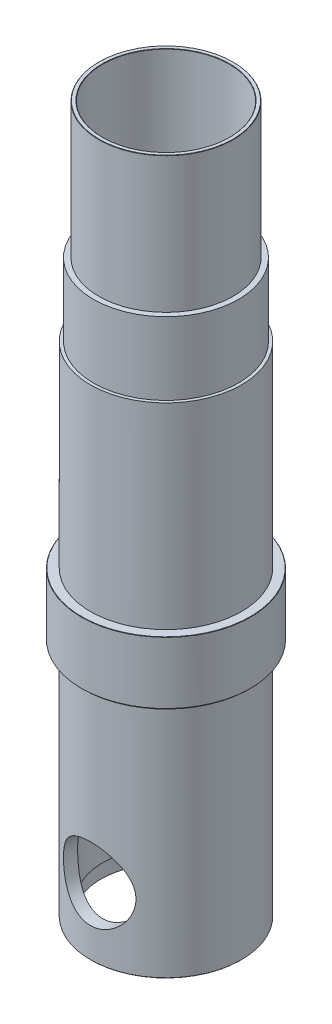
ISO-10303-21;
HEADER;
FILE_DESCRIPTION(('STEP AP214'),'2;1');
FILE_NAME('part.step','',(''),(''),'','','');
FILE_SCHEMA(('AUTOMOTIVE_DESIGN { 1 0 10303 214 1 1 1 1 }'));
ENDSEC;
DATA;
#1=APPLICATION_CONTEXT('core data for automotive mechanical design processes');
#2=APPLICATION_PROTOCOL_DEFINITION('international standard','automotive_design',2000,#1);
#3=PRODUCT_CONTEXT('',#1,'mechanical');
#4=PRODUCT('Part','Part','',(#3));
#5=PRODUCT_RELATED_PRODUCT_CATEGORY('part','',(#4));
#6=PRODUCT_DEFINITION_FORMATION('','',#4);
#7=PRODUCT_DEFINITION_CONTEXT('part definition',#1,'design');
#8=PRODUCT_DEFINITION('design','',#6,#7);
#9=PRODUCT_DEFINITION_SHAPE('','',#8);
#10=(LENGTH_UNIT() NAMED_UNIT(*) SI_UNIT(.MILLI.,.METRE.));
#11=(NAMED_UNIT(*) PLANE_ANGLE_UNIT() SI_UNIT($,.RADIAN.));
#12=(NAMED_UNIT(*) SI_UNIT($,.STERADIAN.) SOLID_ANGLE_UNIT());
#13=UNCERTAINTY_MEASURE_WITH_UNIT(LENGTH_MEASURE(1.E-05),#10,'distance_accuracy_value','');
#14=(GEOMETRIC_REPRESENTATION_CONTEXT(3) GLOBAL_UNCERTAINTY_ASSIGNED_CONTEXT((#13)) GLOBAL_UNIT_ASSIGNED_CONTEXT((#10,
#11,#12)) REPRESENTATION_CONTEXT('',''));
#15=CARTESIAN_POINT('',(0.,0.,0.));
#16=DIRECTION('',(0.,0.,1.));
#17=DIRECTION('',(1.,0.,0.));
#18=AXIS2_PLACEMENT_3D('',#15,#16,#17);
#19=CARTESIAN_POINT('',(0.,89.,0.));
#20=DIRECTION('',(0.,1.,0.));
#21=DIRECTION('',(0.,0.,1.));
#22=AXIS2_PLACEMENT_3D('',#19,#20,#21);
#23=PLANE('',#22);
#24=CARTESIAN_POINT('',(0.,89.,0.));
#25=DIRECTION('',(0.,1.,0.));
#26=DIRECTION('',(0.,0.,1.));
#27=AXIS2_PLACEMENT_3D('',#24,#25,#26);
#28=CIRCLE('',#27,24.);
#29=CARTESIAN_POINT('',(0.,89.,24.));
#30=VERTEX_POINT('',#29);
#31=EDGE_CURVE('E230',#30,#30,#28,.T.);
#32=ORIENTED_EDGE('',*,*,#31,.T.);
#33=EDGE_LOOP('',(#32));
#34=FACE_BOUND('',#33,.T.);
#35=CARTESIAN_POINT('',(0.,89.,0.));
#36=DIRECTION('',(0.,1.,0.));
#37=DIRECTION('',(0.,0.,1.));
#38=AXIS2_PLACEMENT_3D('',#35,#36,#37);
#39=CIRCLE('',#38,22.25);
#40=CARTESIAN_POINT('',(0.,89.,-22.25));
#41=VERTEX_POINT('',#40);
#42=EDGE_CURVE('E106',#41,#41,#39,.T.);
#43=ORIENTED_EDGE('',*,*,#42,.F.);
#44=EDGE_LOOP('',(#43));
#45=FACE_BOUND('',#44,.T.);
#46=ADVANCED_FACE('F39',(#34,#45),#23,.T.);
#47=CARTESIAN_POINT('',(0.,65.,0.));
#48=DIRECTION('',(0.,-1.,0.));
#49=DIRECTION('',(0.,0.,-1.));
#50=AXIS2_PLACEMENT_3D('',#47,#48,#49);
#51=CYLINDRICAL_SURFACE('',#50,21.);
#52=CARTESIAN_POINT('',(0.,-66.,-21.));
#53=CARTESIAN_POINT('',(-0.309522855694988,-66.0000026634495,-20.9999975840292));
#54=CARTESIAN_POINT('',(-0.619141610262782,-66.0119944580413,-20.9931388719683));
#55=CARTESIAN_POINT('',(-1.23606791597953,-66.0598171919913,-20.965867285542));
#56=CARTESIAN_POINT('',(-1.5433739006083,-66.0956630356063,-20.9454459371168));
#57=CARTESIAN_POINT('',(-2.15388740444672,-66.1908332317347,-20.891502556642));
#58=CARTESIAN_POINT('',(-2.4570839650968,-66.250210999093,-20.857950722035));
#59=CARTESIAN_POINT('',(-3.05642213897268,-66.3916801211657,-20.7785867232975));
#60=CARTESIAN_POINT('',(-3.35256478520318,-66.4737681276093,-20.7327763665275));
#61=CARTESIAN_POINT('',(-3.93453085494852,-66.6592635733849,-20.6302293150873));
#62=CARTESIAN_POINT('',(-4.22039675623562,-66.7625674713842,-20.5735457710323));
#63=CARTESIAN_POINT('',(-4.78167205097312,-66.9896740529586,-20.4503833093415));
#64=CARTESIAN_POINT('',(-5.05708109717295,-67.113477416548,-20.3839040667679));
#65=CARTESIAN_POINT('',(-5.59592002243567,-67.3803939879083,-20.2426090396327));
#66=CARTESIAN_POINT('',(-5.85935674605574,-67.5234959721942,-20.1677981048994));
#67=CARTESIAN_POINT('',(-6.37339229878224,-67.8280210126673,-20.0112990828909));
#68=CARTESIAN_POINT('',(-6.62398635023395,-67.9894508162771,-19.9296084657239));
#69=CARTESIAN_POINT('',(-7.12887289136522,-68.341809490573,-19.7548873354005));
#70=CARTESIAN_POINT('',(-7.38213105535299,-68.5340257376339,-19.6614638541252));
#71=CARTESIAN_POINT('',(-7.8717373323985,-68.9370914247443,-19.4706137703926));
#72=CARTESIAN_POINT('',(-8.10808478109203,-69.1479415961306,-19.3731870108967));
#73=CARTESIAN_POINT('',(-8.56325309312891,-69.5874560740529,-19.1763459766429));
#74=CARTESIAN_POINT('',(-8.78205408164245,-69.8161400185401,-19.0769296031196));
#75=CARTESIAN_POINT('',(-9.20099297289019,-70.2901499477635,-18.8784391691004));
#76=CARTESIAN_POINT('',(-9.40113029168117,-70.5354764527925,-18.7793651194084));
#77=CARTESIAN_POINT('',(-9.80259627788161,-71.0694524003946,-18.5732442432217));
#78=CARTESIAN_POINT('',(-10.0016840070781,-71.3599109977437,-18.4665032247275));
#79=CARTESIAN_POINT('',(-10.3745172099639,-71.9589840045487,-18.2596512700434));
#80=CARTESIAN_POINT('',(-10.5482590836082,-72.2676009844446,-18.1595412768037));
#81=CARTESIAN_POINT('',(-10.8686484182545,-72.901144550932,-17.9696169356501));
#82=CARTESIAN_POINT('',(-11.0153291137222,-73.2260505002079,-17.8797900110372));
#83=CARTESIAN_POINT('',(-11.2801227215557,-73.8906602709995,-17.7139289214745));
#84=CARTESIAN_POINT('',(-11.3982450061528,-74.2303591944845,-17.6378902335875));
#85=CARTESIAN_POINT('',(-11.5813844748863,-74.8455533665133,-17.5180108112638));
#86=CARTESIAN_POINT('',(-11.6523689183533,-75.1186221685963,-17.4707685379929));
#87=CARTESIAN_POINT('',(-11.7751744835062,-75.6707914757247,-17.3882361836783));
#88=CARTESIAN_POINT('',(-11.8269994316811,-75.9498907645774,-17.3529437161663));
#89=CARTESIAN_POINT('',(-11.9107942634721,-76.5121507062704,-17.2955360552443));
#90=CARTESIAN_POINT('',(-11.9427817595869,-76.7953075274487,-17.2734091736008));
#91=CARTESIAN_POINT('',(-11.9865229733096,-77.363938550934,-17.2430850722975));
#92=CARTESIAN_POINT('',(-11.9982762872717,-77.6494127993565,-17.2348881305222));
#93=CARTESIAN_POINT('',(-12.0013734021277,-78.2209147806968,-17.2327316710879));
#94=CARTESIAN_POINT('',(-11.9926894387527,-78.5069427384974,-17.238791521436));
#95=CARTESIAN_POINT('',(-11.9549853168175,-79.0769997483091,-17.2649600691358));
#96=CARTESIAN_POINT('',(-11.9259650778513,-79.3610287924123,-17.2850688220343));
#97=CARTESIAN_POINT('',(-11.8479826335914,-79.9252168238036,-17.3386139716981));
#98=CARTESIAN_POINT('',(-11.7990088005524,-80.2053734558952,-17.372058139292));
#99=CARTESIAN_POINT('',(-11.6817610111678,-80.7598505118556,-17.4511158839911));
#100=CARTESIAN_POINT('',(-11.6134865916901,-81.034170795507,-17.496729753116));
#101=CARTESIAN_POINT('',(-11.4587399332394,-81.5743361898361,-17.5984602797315));
#102=CARTESIAN_POINT('',(-11.3723450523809,-81.840211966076,-17.654532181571));
#103=CARTESIAN_POINT('',(-11.1820018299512,-82.3635333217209,-17.7757011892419));
#104=CARTESIAN_POINT('',(-11.0780473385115,-82.6209759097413,-17.8408014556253));
#105=CARTESIAN_POINT('',(-10.741117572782,-83.3790408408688,-18.0470991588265));
#106=CARTESIAN_POINT('',(-10.4829969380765,-83.8656727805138,-18.1993477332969));
#107=CARTESIAN_POINT('',(-9.85934987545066,-84.8699724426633,-18.5456054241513));
#108=CARTESIAN_POINT('',(-9.48324018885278,-85.380116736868,-18.742396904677));
#109=CARTESIAN_POINT('',(-8.86325467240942,-86.0958392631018,-19.0393169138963));
#110=CARTESIAN_POINT('',(-8.6470779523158,-86.3263424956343,-19.1386658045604));
#111=CARTESIAN_POINT('',(-8.19687346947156,-86.7698939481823,-19.335758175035));
#112=CARTESIAN_POINT('',(-7.96285155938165,-86.9829478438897,-19.4335021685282));
#113=CARTESIAN_POINT('',(-7.45005653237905,-87.4138882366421,-19.6362195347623));
#114=CARTESIAN_POINT('',(-7.16922574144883,-87.629543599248,-19.7407422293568));
#115=CARTESIAN_POINT('',(-6.58773491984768,-88.0363159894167,-19.9423276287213));
#116=CARTESIAN_POINT('',(-6.2870730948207,-88.2274307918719,-20.0393896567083));
#117=CARTESIAN_POINT('',(-5.66769121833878,-88.5832301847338,-20.2232929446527));
#118=CARTESIAN_POINT('',(-5.34897958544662,-88.7479269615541,-20.3101389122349));
#119=CARTESIAN_POINT('',(-4.69540902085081,-89.0490970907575,-20.4711099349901));
#120=CARTESIAN_POINT('',(-4.36055209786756,-89.1855739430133,-20.5452365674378));
#121=CARTESIAN_POINT('',(-3.70080771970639,-89.4200692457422,-20.6738737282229));
#122=CARTESIAN_POINT('',(-3.37682840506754,-89.5200925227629,-20.7293853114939));
#123=CARTESIAN_POINT('',(-2.71950215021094,-89.6927219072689,-20.8258159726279));
#124=CARTESIAN_POINT('',(-2.38615555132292,-89.76532901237,-20.8667355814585));
#125=CARTESIAN_POINT('',(-1.71322805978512,-89.8819764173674,-20.9327267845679));
#126=CARTESIAN_POINT('',(-1.37365252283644,-89.9260401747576,-20.9578113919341));
#127=CARTESIAN_POINT('',(-0.691174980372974,-89.9849716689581,-20.9914017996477));
#128=CARTESIAN_POINT('',(-0.348273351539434,-89.9998426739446,-20.9999094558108));
#129=CARTESIAN_POINT('',(0.295857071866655,-90.0001359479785,-21.0000782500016));
#130=CARTESIAN_POINT('',(0.597090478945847,-89.9889146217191,-20.9936594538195));
#131=CARTESIAN_POINT('',(1.19729317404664,-89.9439119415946,-20.9679919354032));
#132=CARTESIAN_POINT('',(1.49626268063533,-89.9101327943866,-20.9487444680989));
#133=CARTESIAN_POINT('',(2.08978082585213,-89.8204443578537,-20.8978837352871));
#134=CARTESIAN_POINT('',(2.38432948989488,-89.764535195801,-20.8662705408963));
#135=CARTESIAN_POINT('',(2.96701920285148,-89.631256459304,-20.7914186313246));
#136=CARTESIAN_POINT('',(3.25516005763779,-89.5538862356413,-20.7481795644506));
#137=CARTESIAN_POINT('',(3.82029452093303,-89.3794508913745,-20.6515541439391));
#138=CARTESIAN_POINT('',(4.09737271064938,-89.2825982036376,-20.5982776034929));
#139=CARTESIAN_POINT('',(4.64200153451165,-89.0696575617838,-20.4824154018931));
#140=CARTESIAN_POINT('',(4.90955235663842,-88.9535699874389,-20.4198299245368));
#141=CARTESIAN_POINT('',(5.43386830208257,-88.7031529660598,-20.286602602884));
#142=CARTESIAN_POINT('',(5.69063364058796,-88.5688238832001,-20.2159609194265));
#143=CARTESIAN_POINT('',(6.19242141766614,-88.282866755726,-20.0679440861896));
#144=CARTESIAN_POINT('',(6.43743957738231,-88.1312324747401,-19.9905665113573));
#145=CARTESIAN_POINT('',(6.93958344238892,-87.7950352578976,-19.8221944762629));
#146=CARTESIAN_POINT('',(7.19532119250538,-87.6086879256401,-19.7306205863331));
#147=CARTESIAN_POINT('',(7.69031721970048,-87.2172986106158,-19.5430063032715));
#148=CARTESIAN_POINT('',(7.92957448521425,-87.0122554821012,-19.4469656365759));
#149=CARTESIAN_POINT('',(8.3909773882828,-86.5843233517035,-19.2523830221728));
#150=CARTESIAN_POINT('',(8.6131045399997,-86.3614155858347,-19.1538385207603));
#151=CARTESIAN_POINT('',(9.03913771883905,-85.8989147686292,-18.9565057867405));
#152=CARTESIAN_POINT('',(9.24304301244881,-85.6593210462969,-18.8577175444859));
#153=CARTESIAN_POINT('',(9.65350316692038,-85.1366843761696,-18.6512297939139));
#154=CARTESIAN_POINT('',(9.85781121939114,-84.8517772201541,-18.5437670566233));
#155=CARTESIAN_POINT('',(10.2415981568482,-84.2636237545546,-18.3345970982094));
#156=CARTESIAN_POINT('',(10.4210734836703,-83.9603748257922,-18.2328907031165));
#157=CARTESIAN_POINT('',(10.753525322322,-83.3372517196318,-18.0388112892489));
#158=CARTESIAN_POINT('',(10.9065301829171,-83.0173958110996,-17.9464283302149));
#159=CARTESIAN_POINT('',(11.1845964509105,-82.362482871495,-17.7744636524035));
#160=CARTESIAN_POINT('',(11.3096664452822,-82.0274305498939,-17.6948780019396));
#161=CARTESIAN_POINT('',(11.5066147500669,-81.4172425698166,-17.5672561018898));
#162=CARTESIAN_POINT('',(11.5841485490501,-81.1445714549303,-17.516111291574));
#163=CARTESIAN_POINT('',(11.7200307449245,-80.5926079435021,-17.4254860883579));
#164=CARTESIAN_POINT('',(11.7783829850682,-80.3133168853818,-17.3860033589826));
#165=CARTESIAN_POINT('',(11.8751392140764,-79.7500422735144,-17.3200607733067));
#166=CARTESIAN_POINT('',(11.91356192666,-79.4660633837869,-17.2935886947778));
#167=CARTESIAN_POINT('',(11.9700062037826,-78.8951171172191,-17.2545686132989));
#168=CARTESIAN_POINT('',(11.9880274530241,-78.6081496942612,-17.2420208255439));
#169=CARTESIAN_POINT('',(12.0034121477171,-78.0328075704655,-17.2313141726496));
#170=CARTESIAN_POINT('',(12.0007336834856,-77.7444311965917,-17.2331844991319));
#171=CARTESIAN_POINT('',(11.9746606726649,-77.1690765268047,-17.2513115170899));
#172=CARTESIAN_POINT('',(11.9512660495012,-76.8820982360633,-17.267568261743));
#173=CARTESIAN_POINT('',(11.8840905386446,-76.3115204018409,-17.3138686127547));
#174=CARTESIAN_POINT('',(11.840298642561,-76.0279227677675,-17.3439196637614));
#175=CARTESIAN_POINT('',(11.7329246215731,-75.4661761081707,-17.4167354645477));
#176=CARTESIAN_POINT('',(11.6693421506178,-75.1880271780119,-17.4595004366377));
#177=CARTESIAN_POINT('',(11.5244478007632,-74.6436560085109,-17.5554693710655));
#178=CARTESIAN_POINT('',(11.4434682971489,-74.3773099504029,-17.6084759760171));
#179=CARTESIAN_POINT('',(11.2639296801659,-73.8526143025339,-17.7238615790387));
#180=CARTESIAN_POINT('',(11.1653645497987,-73.5942674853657,-17.7862437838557));
#181=CARTESIAN_POINT('',(10.9514749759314,-73.0866440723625,-17.9187335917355));
#182=CARTESIAN_POINT('',(10.8361489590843,-72.8373683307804,-17.9888419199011));
#183=CARTESIAN_POINT('',(10.5895232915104,-72.3487254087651,-18.1351192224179));
#184=CARTESIAN_POINT('',(10.4582238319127,-72.1093581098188,-18.2112881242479));
#185=CARTESIAN_POINT('',(10.1589355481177,-71.6051017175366,-18.3801499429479));
#186=CARTESIAN_POINT('',(9.98841069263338,-71.3419620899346,-18.4735807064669));
#187=CARTESIAN_POINT('',(9.62798728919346,-70.8306400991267,-18.6639600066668));
#188=CARTESIAN_POINT('',(9.438086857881,-70.5824591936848,-18.7609088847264));
#189=CARTESIAN_POINT('',(9.03964643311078,-70.1017524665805,-18.9561081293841));
#190=CARTESIAN_POINT('',(8.8310930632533,-69.8692380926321,-19.0543593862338));
#191=CARTESIAN_POINT('',(8.39625729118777,-69.4209324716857,-19.249927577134));
#192=CARTESIAN_POINT('',(8.16997209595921,-69.2051438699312,-19.3472443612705));
#193=CARTESIAN_POINT('',(7.67117303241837,-68.7654455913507,-19.5508162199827));
#194=CARTESIAN_POINT('',(7.39641492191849,-68.5438864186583,-19.6566700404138));
#195=CARTESIAN_POINT('',(6.82689863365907,-68.124860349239,-19.8616466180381));
#196=CARTESIAN_POINT('',(6.53214774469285,-67.9273847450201,-19.9607718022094));
#197=CARTESIAN_POINT('',(5.92409184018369,-67.5581789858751,-20.1496021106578));
#198=CARTESIAN_POINT('',(5.61078863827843,-67.3864463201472,-20.2393081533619));
#199=CARTESIAN_POINT('',(4.96753731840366,-67.0705961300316,-20.4067128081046));
#200=CARTESIAN_POINT('',(4.63759381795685,-66.9264709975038,-20.4844147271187));
#201=CARTESIAN_POINT('',(4.02338086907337,-66.6906868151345,-20.6129238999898));
#202=CARTESIAN_POINT('',(3.74142065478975,-66.5942555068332,-20.6660566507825));
#203=CARTESIAN_POINT('',(3.1694310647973,-66.4222693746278,-20.7614719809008));
#204=CARTESIAN_POINT('',(2.87940312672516,-66.3467108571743,-20.8037564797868));
#205=CARTESIAN_POINT('',(2.29381256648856,-66.2174652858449,-20.8764287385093));
#206=CARTESIAN_POINT('',(1.99826532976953,-66.1637248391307,-20.9068455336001));
#207=CARTESIAN_POINT('',(1.40308275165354,-66.0785220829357,-20.9551997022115));
#208=CARTESIAN_POINT('',(1.10344983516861,-66.0470470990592,-20.9731441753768));
#209=CARTESIAN_POINT('',(0.669340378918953,-66.0179331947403,-20.9897566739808));
#210=CARTESIAN_POINT('',(0.535603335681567,-66.0112110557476,-20.9935953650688));
#211=CARTESIAN_POINT('',(0.267916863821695,-66.0022436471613,-20.9987176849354));
#212=CARTESIAN_POINT('',(0.133967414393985,-65.9999988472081,-21.0000010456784));
#213=CARTESIAN_POINT('',(0.,-66.,-21.));
#214=B_SPLINE_CURVE_WITH_KNOTS('',3,(#52,#53,#54,#55,#56,#57,#58,#59,#60,#61,#62,#63,#64,#65,
#66,#67,#68,#69,#70,#71,#72,#73,#74,#75,#76,#77,#78,#79,#80,#81,#82,#83,#84,#85,#86,#87,#88,#89,
#90,#91,#92,#93,#94,#95,#96,#97,#98,#99,#100,#101,#102,#103,#104,#105,#106,#107,#108,#109,#110,
#111,#112,#113,#114,#115,#116,#117,#118,#119,#120,#121,#122,#123,#124,#125,#126,#127,#128,#129,
#130,#131,#132,#133,#134,#135,#136,#137,#138,#139,#140,#141,#142,#143,#144,#145,#146,#147,#148,
#149,#150,#151,#152,#153,#154,#155,#156,#157,#158,#159,#160,#161,#162,#163,#164,#165,#166,#167,
#168,#169,#170,#171,#172,#173,#174,#175,#176,#177,#178,#179,#180,#181,#182,#183,#184,#185,#186,
#187,#188,#189,#190,#191,#192,#193,#194,#195,#196,#197,#198,#199,#200,#201,#202,#203,#204,#205,
#206,#207,#208,#209,#210,#211,#212,#213),.UNSPECIFIED.,.T.,.F.,(4,2,2,2,2,2,2,2,2,2,2,2,2,2,2,2,
2,2,2,2,2,2,2,2,2,2,2,2,2,2,2,2,2,2,2,2,2,2,2,2,2,2,2,2,2,2,2,2,2,2,2,2,2,2,2,2,2,2,2,2,2,2,2,2,
2,2,2,2,2,2,2,2,2,2,2,2,2,2,2,2,4),(0.,0.928428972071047,1.85743858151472,2.78856912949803,
3.7195624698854,4.64611581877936,5.57269990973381,6.49874743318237,7.42513699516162,
8.41827045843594,9.4114429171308,10.4057249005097,11.4000379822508,12.502566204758,
13.6052508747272,14.7065721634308,15.8075315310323,16.664868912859,17.5220349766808,
18.3784389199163,19.2348599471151,20.0924451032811,20.9500336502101,21.8081226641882,
22.6662322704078,23.5207504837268,24.3755685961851,26.0843469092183,28.0669593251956,
29.0599862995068,30.052688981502,31.1588589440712,32.2651291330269,33.3708875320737,
34.4765087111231,35.5057877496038,36.5350293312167,37.5634239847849,38.5917035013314,
39.4951301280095,40.3984683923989,41.3018014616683,42.2051618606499,43.0991596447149,
43.9931397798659,44.8871020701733,45.7813875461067,46.7686101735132,47.7558933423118,
48.7442274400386,49.7326013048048,50.8313456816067,51.930247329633,53.0279647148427,
54.1253442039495,54.9886403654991,55.8517634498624,56.7140741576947,57.5763981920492,
58.4404685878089,59.3045421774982,60.1690826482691,61.0336382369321,61.8829498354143,
62.7325525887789,63.5822351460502,64.4319075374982,65.4124821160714,66.3931521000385,
67.3745310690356,68.356064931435,69.4601606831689,70.5638560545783,71.6674437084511,
72.7707267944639,73.6778518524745,74.5848162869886,75.4895476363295,76.3937635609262,
76.7955632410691,77.197405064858),.UNSPECIFIED.);
#215=CARTESIAN_POINT('',(0.,-66.,-21.));
#216=VERTEX_POINT('',#215);
#217=EDGE_CURVE('E103',#216,#216,#214,.T.);
#218=ORIENTED_EDGE('',*,*,#217,.F.);
#219=EDGE_LOOP('',(#218));
#220=FACE_BOUND('',#219,.T.);
#221=CARTESIAN_POINT('',(0.,133.9,0.));
#222=DIRECTION('',(0.,1.,0.));
#223=DIRECTION('',(0.,0.,1.));
#224=AXIS2_PLACEMENT_3D('',#221,#222,#223);
#225=CIRCLE('',#224,21.);
#226=CARTESIAN_POINT('',(0.,133.9,21.));
#227=VERTEX_POINT('',#226);
#228=EDGE_CURVE('E189',#227,#227,#225,.T.);
#229=ORIENTED_EDGE('',*,*,#228,.T.);
#230=EDGE_LOOP('',(#229));
#231=FACE_BOUND('',#230,.T.);
#232=CARTESIAN_POINT('',(0.,-95.,0.));
#233=DIRECTION('',(0.,-1.,0.));
#234=DIRECTION('',(0.,0.,-1.));
#235=AXIS2_PLACEMENT_3D('',#232,#233,#234);
#236=CIRCLE('',#235,21.);
#237=CARTESIAN_POINT('',(0.,-95.,-21.));
#238=VERTEX_POINT('',#237);
#239=EDGE_CURVE('E193',#238,#238,#236,.T.);
#240=ORIENTED_EDGE('',*,*,#239,.T.);
#241=EDGE_LOOP('',(#240));
#242=FACE_BOUND('',#241,.T.);
#243=CARTESIAN_POINT('',(-12.,-78.,17.2336879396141));
#244=CARTESIAN_POINT('',(-11.9999990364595,-78.3052980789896,17.2336893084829));
#245=CARTESIAN_POINT('',(-11.98833140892,-78.6106098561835,17.2418307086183));
#246=CARTESIAN_POINT('',(-11.9418570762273,-79.2186192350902,17.2740508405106));
#247=CARTESIAN_POINT('',(-11.907048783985,-79.5213166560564,17.2981306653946));
#248=CARTESIAN_POINT('',(-11.8148147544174,-80.1219223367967,17.3612575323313));
#249=CARTESIAN_POINT('',(-11.7573685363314,-80.4198260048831,17.4003181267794));
#250=CARTESIAN_POINT('',(-11.6206932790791,-81.0084541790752,17.491890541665));
#251=CARTESIAN_POINT('',(-11.541463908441,-81.2991785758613,17.5444025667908));
#252=CARTESIAN_POINT('',(-11.3628178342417,-81.8697740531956,17.6606237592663));
#253=CARTESIAN_POINT('',(-11.2635418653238,-82.1497054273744,17.7242544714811));
#254=CARTESIAN_POINT('',(-11.0454371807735,-82.6995574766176,17.8609876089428));
#255=CARTESIAN_POINT('',(-10.9266007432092,-82.9694741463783,17.9340937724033));
#256=CARTESIAN_POINT('',(-10.6703658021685,-83.4981443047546,18.0877195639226));
#257=CARTESIAN_POINT('',(-10.5329665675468,-83.7568973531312,18.1682394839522));
#258=CARTESIAN_POINT('',(-10.2405130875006,-84.2623598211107,18.3346719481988));
#259=CARTESIAN_POINT('',(-10.0854600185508,-84.5090700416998,18.4205841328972));
#260=CARTESIAN_POINT('',(-9.74050895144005,-85.0161646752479,18.6055062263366));
#261=CARTESIAN_POINT('',(-9.54865424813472,-85.2750731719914,18.7049180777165));
#262=CARTESIAN_POINT('',(-9.14513376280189,-85.776248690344,18.9054832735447));
#263=CARTESIAN_POINT('',(-8.93346677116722,-86.0185146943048,19.0066367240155));
#264=CARTESIAN_POINT('',(-8.49104462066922,-86.4856182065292,19.2083656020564));
#265=CARTESIAN_POINT('',(-8.26027425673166,-86.7104415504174,19.3089404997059));
#266=CARTESIAN_POINT('',(-7.78077689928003,-87.1413000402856,19.5070958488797));
#267=CARTESIAN_POINT('',(-7.53205621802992,-87.3473417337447,19.6046773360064));
#268=CARTESIAN_POINT('',(-6.99299593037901,-87.7582544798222,19.803742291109));
#269=CARTESIAN_POINT('',(-6.70094887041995,-87.9611431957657,19.9047115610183));
#270=CARTESIAN_POINT('',(-6.09780655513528,-88.341365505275,20.0976866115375));
#271=CARTESIAN_POINT('',(-5.7867097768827,-88.5186970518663,20.1896916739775));
#272=CARTESIAN_POINT('',(-5.14750457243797,-88.8458286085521,20.3620401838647));
#273=CARTESIAN_POINT('',(-4.81940702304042,-88.9956459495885,20.4423909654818));
#274=CARTESIAN_POINT('',(-4.148334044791,-89.2659716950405,20.5890557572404));
#275=CARTESIAN_POINT('',(-3.80536079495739,-89.3864843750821,20.6553718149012));
#276=CARTESIAN_POINT('',(-3.13822138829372,-89.5871461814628,20.7666952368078));
#277=CARTESIAN_POINT('',(-2.81507211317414,-89.669921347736,20.8130678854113));
#278=CARTESIAN_POINT('',(-2.16128068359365,-89.8084924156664,20.8910795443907));
#279=CARTESIAN_POINT('',(-1.8306389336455,-89.8642897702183,20.9227193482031));
#280=CARTESIAN_POINT('',(-1.16495631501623,-89.9480265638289,20.9703159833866));
#281=CARTESIAN_POINT('',(-0.829918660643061,-89.9759853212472,20.9862836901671));
#282=CARTESIAN_POINT('',(-0.15831030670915,-90.0036602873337,21.0020885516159));
#283=CARTESIAN_POINT('',(0.178260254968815,-90.0033789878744,21.0019271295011));
#284=CARTESIAN_POINT('',(0.811821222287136,-89.9762200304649,20.9864184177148));
#285=CARTESIAN_POINT('',(1.1089885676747,-89.9523498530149,20.9727883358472));
#286=CARTESIAN_POINT('',(1.69988863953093,-89.88271274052,20.9331803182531));
#287=CARTESIAN_POINT('',(1.9936216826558,-89.8369478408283,20.9072035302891));
#288=CARTESIAN_POINT('',(2.57565631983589,-89.7240729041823,20.8435054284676));
#289=CARTESIAN_POINT('',(2.86395773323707,-89.6569621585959,20.8057837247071));
#290=CARTESIAN_POINT('',(3.43330417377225,-89.5021503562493,20.719443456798));
#291=CARTESIAN_POINT('',(3.71434891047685,-89.4144484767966,20.6708244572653));
#292=CARTESIAN_POINT('',(4.26999972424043,-89.2184961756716,20.5632656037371));
#293=CARTESIAN_POINT('',(4.54452754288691,-89.1100719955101,20.5042388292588));
#294=CARTESIAN_POINT('',(5.08315206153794,-88.8741902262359,20.3773925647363));
#295=CARTESIAN_POINT('',(5.34724882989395,-88.7467327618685,20.30957313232));
#296=CARTESIAN_POINT('',(5.86385335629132,-88.4738041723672,20.1664838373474));
#297=CARTESIAN_POINT('',(6.11636076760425,-88.3283325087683,20.0912137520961));
#298=CARTESIAN_POINT('',(6.60888984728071,-88.0203283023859,19.9346278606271));
#299=CARTESIAN_POINT('',(6.8489069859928,-87.8577896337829,19.853309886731));
#300=CARTESIAN_POINT('',(7.34190557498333,-87.4973622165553,19.6766992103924));
#301=CARTESIAN_POINT('',(7.59329165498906,-87.2975542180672,19.5808652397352));
#302=CARTESIAN_POINT('',(8.07851435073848,-86.8792028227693,19.3857165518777));
#303=CARTESIAN_POINT('',(8.31234966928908,-86.6606580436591,19.2864015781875));
#304=CARTESIAN_POINT('',(8.76183994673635,-86.2056411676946,19.0864019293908));
#305=CARTESIAN_POINT('',(8.97747358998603,-85.9691486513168,18.9857158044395));
#306=CARTESIAN_POINT('',(9.38937876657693,-85.4794349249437,18.7854204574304));
#307=CARTESIAN_POINT('',(9.58564992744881,-85.2262133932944,18.6858112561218));
#308=CARTESIAN_POINT('',(9.97649045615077,-84.6778754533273,18.4803440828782));
#309=CARTESIAN_POINT('',(10.1689346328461,-84.3811001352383,18.3748547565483));
#310=CARTESIAN_POINT('',(10.5278955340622,-83.7696702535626,18.1715708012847));
#311=CARTESIAN_POINT('',(10.6944086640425,-83.455013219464,18.0737772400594));
#312=CARTESIAN_POINT('',(10.9996577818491,-82.8098531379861,17.8896414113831));
#313=CARTESIAN_POINT('',(11.13843412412,-82.4793739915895,17.8032825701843));
#314=CARTESIAN_POINT('',(11.3867207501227,-81.8041879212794,17.6455170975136));
#315=CARTESIAN_POINT('',(11.4962412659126,-81.4594860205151,17.5741052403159));
#316=CARTESIAN_POINT('',(11.6627463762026,-80.838780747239,17.4639022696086));
#317=CARTESIAN_POINT('',(11.7260180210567,-80.5651103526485,17.421385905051));
#318=CARTESIAN_POINT('',(11.8333957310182,-80.0124461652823,17.3486302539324));
#319=CARTESIAN_POINT('',(11.8775055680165,-79.7334534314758,17.3183885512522));
#320=CARTESIAN_POINT('',(11.9459586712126,-79.1721535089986,17.2712421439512));
#321=CARTESIAN_POINT('',(11.9703176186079,-78.8898491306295,17.2543268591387));
#322=CARTESIAN_POINT('',(11.9989804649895,-78.3237197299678,17.2344067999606));
#323=CARTESIAN_POINT('',(12.0032838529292,-78.0398946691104,17.2314023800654));
#324=CARTESIAN_POINT('',(11.9917662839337,-77.4726948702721,17.239419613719));
#325=CARTESIAN_POINT('',(11.975934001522,-77.1893204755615,17.2504491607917));
#326=CARTESIAN_POINT('',(11.924358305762,-76.6252670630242,17.2861405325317));
#327=CARTESIAN_POINT('',(11.8886148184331,-76.3445880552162,17.3108024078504));
#328=CARTESIAN_POINT('',(11.7976805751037,-75.7876722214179,17.372902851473));
#329=CARTESIAN_POINT('',(11.7424779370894,-75.5114382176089,17.4103492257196));
#330=CARTESIAN_POINT('',(11.6133145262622,-74.9652513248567,17.4967697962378));
#331=CARTESIAN_POINT('',(11.5393531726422,-74.6952986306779,17.5457443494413));
#332=CARTESIAN_POINT('',(11.3724392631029,-74.1597885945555,17.6543944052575));
#333=CARTESIAN_POINT('',(11.279265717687,-73.8943252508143,17.7141933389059));
#334=CARTESIAN_POINT('',(11.0753569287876,-73.3723565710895,17.8423932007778));
#335=CARTESIAN_POINT('',(10.9646154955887,-73.1158544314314,17.9107971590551));
#336=CARTESIAN_POINT('',(10.6072139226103,-72.3611579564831,18.126341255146));
#337=CARTESIAN_POINT('',(10.335296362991,-71.8775193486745,18.2838680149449));
#338=CARTESIAN_POINT('',(9.8566916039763,-71.1480477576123,18.5441647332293));
#339=CARTESIAN_POINT('',(9.66998343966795,-70.8870434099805,18.6424251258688));
#340=CARTESIAN_POINT('',(9.27676106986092,-70.3813282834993,18.8411829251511));
#341=CARTESIAN_POINT('',(9.07025253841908,-70.1366128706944,18.941679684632));
#342=CARTESIAN_POINT('',(8.63808476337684,-69.6641652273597,19.1426319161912));
#343=CARTESIAN_POINT('',(8.41240375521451,-69.4364528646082,19.2430872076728));
#344=CARTESIAN_POINT('',(7.94304607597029,-68.9994001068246,19.4415255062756));
#345=CARTESIAN_POINT('',(7.69937569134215,-68.7900533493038,19.5395093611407));
#346=CARTESIAN_POINT('',(7.16956427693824,-68.370741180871,19.7404518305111));
#347=CARTESIAN_POINT('',(6.88161473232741,-68.1628194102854,19.842923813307));
#348=CARTESIAN_POINT('',(6.28634089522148,-67.7721626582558,20.0394650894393));
#349=CARTESIAN_POINT('',(5.97901496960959,-67.5894298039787,20.1335336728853));
#350=CARTESIAN_POINT('',(5.34693226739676,-67.2511061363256,20.310537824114));
#351=CARTESIAN_POINT('',(5.02218615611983,-67.0954989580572,20.3934800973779));
#352=CARTESIAN_POINT('',(4.35730202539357,-66.8132086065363,20.5458066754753));
#353=CARTESIAN_POINT('',(4.01716614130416,-66.6865214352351,20.6151928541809));
#354=CARTESIAN_POINT('',(3.3524272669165,-66.4729451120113,20.7332038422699));
#355=CARTESIAN_POINT('',(3.02881351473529,-66.3836558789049,20.7830588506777));
#356=CARTESIAN_POINT('',(2.37338361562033,-66.2322412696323,20.8680667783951));
#357=CARTESIAN_POINT('',(2.04156785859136,-66.1701146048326,20.9032203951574));
#358=CARTESIAN_POINT('',(1.37284688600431,-66.0740067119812,20.9577611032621));
#359=CARTESIAN_POINT('',(1.0359456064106,-66.0400047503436,20.9771598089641));
#360=CARTESIAN_POINT('',(0.35994343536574,-66.0006235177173,20.9996372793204));
#361=CARTESIAN_POINT('',(0.0208427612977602,-65.9952414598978,21.0027176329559));
#362=CARTESIAN_POINT('',(-0.616833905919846,-66.0121275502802,20.9930718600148));
#363=CARTESIAN_POINT('',(-0.915526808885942,-66.0312462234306,20.9821461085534));
#364=CARTESIAN_POINT('',(-1.50991281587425,-66.0916257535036,20.9477625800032));
#365=CARTESIAN_POINT('',(-1.80560620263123,-66.1328845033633,20.92430599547));
#366=CARTESIAN_POINT('',(-2.39193610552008,-66.2370363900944,20.8654132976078));
#367=CARTESIAN_POINT('',(-2.68257252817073,-66.2999299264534,20.8299769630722));
#368=CARTESIAN_POINT('',(-3.25690347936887,-66.4466267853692,20.7479333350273));
#369=CARTESIAN_POINT('',(-3.5405977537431,-66.5304308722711,20.7013256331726));
#370=CARTESIAN_POINT('',(-4.09979623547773,-66.7182091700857,20.5978799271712));
#371=CARTESIAN_POINT('',(-4.37528710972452,-66.8222143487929,20.5410262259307));
#372=CARTESIAN_POINT('',(-4.91618188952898,-67.0493287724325,20.4183268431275));
#373=CARTESIAN_POINT('',(-5.18158591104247,-67.1724377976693,20.3524812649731));
#374=CARTESIAN_POINT('',(-5.70111190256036,-67.4367490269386,20.2131062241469));
#375=CARTESIAN_POINT('',(-5.95523375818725,-67.5779514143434,20.1395766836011));
#376=CARTESIAN_POINT('',(-6.45127735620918,-67.8774998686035,19.9862065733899));
#377=CARTESIAN_POINT('',(-6.69319466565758,-68.0358520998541,19.9063637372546));
#378=CARTESIAN_POINT('',(-7.18974249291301,-68.3869914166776,19.7328189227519));
#379=CARTESIAN_POINT('',(-7.44285520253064,-68.5816503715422,19.6385575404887));
#380=CARTESIAN_POINT('',(-7.93194222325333,-68.9896870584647,19.4461658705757));
#381=CARTESIAN_POINT('',(-8.16791534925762,-69.2030660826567,19.3480353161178));
#382=CARTESIAN_POINT('',(-8.62209596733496,-69.6477205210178,19.1499583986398));
#383=CARTESIAN_POINT('',(-8.84028313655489,-69.8790158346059,19.0500101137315));
#384=CARTESIAN_POINT('',(-9.25773866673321,-70.3583192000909,18.8506707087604));
#385=CARTESIAN_POINT('',(-9.45700650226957,-70.6063277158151,18.7512796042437));
#386=CARTESIAN_POINT('',(-9.8555804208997,-71.1449847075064,18.5451610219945));
#387=CARTESIAN_POINT('',(-10.0527030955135,-71.4373782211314,18.4387559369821));
#388=CARTESIAN_POINT('',(-10.4214281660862,-72.0402438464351,18.2328945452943));
#389=CARTESIAN_POINT('',(-10.5930269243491,-72.3507185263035,18.1334392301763));
#390=CARTESIAN_POINT('',(-10.9089141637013,-72.9878308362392,17.9451767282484));
#391=CARTESIAN_POINT('',(-11.0532392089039,-73.3144460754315,17.8563553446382));
#392=CARTESIAN_POINT('',(-11.3131093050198,-73.9823100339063,17.6928563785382));
#393=CARTESIAN_POINT('',(-11.4286641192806,-74.323553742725,17.6181739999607));
#394=CARTESIAN_POINT('',(-11.6061693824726,-74.9382463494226,17.5015813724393));
#395=CARTESIAN_POINT('',(-11.6743359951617,-75.2092343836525,17.4560842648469));
#396=CARTESIAN_POINT('',(-11.7918243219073,-75.7569479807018,17.3769362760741));
#397=CARTESIAN_POINT('',(-11.8411497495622,-76.0336724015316,17.343283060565));
#398=CARTESIAN_POINT('',(-11.9203065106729,-76.5909466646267,17.2889735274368));
#399=CARTESIAN_POINT('',(-11.9501531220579,-76.8714933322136,17.2683070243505));
#400=CARTESIAN_POINT('',(-11.9900010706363,-77.4346893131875,17.2406630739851));
#401=CARTESIAN_POINT('',(-12.0000008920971,-77.7173387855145,17.2336866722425));
#402=CARTESIAN_POINT('',(-12.,-78.,17.2336879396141));
#403=B_SPLINE_CURVE_WITH_KNOTS('',3,(#243,#244,#245,#246,#247,#248,#249,#250,#251,#252,#253,
#254,#255,#256,#257,#258,#259,#260,#261,#262,#263,#264,#265,#266,#267,#268,#269,#270,#271,#272,
#273,#274,#275,#276,#277,#278,#279,#280,#281,#282,#283,#284,#285,#286,#287,#288,#289,#290,#291,
#292,#293,#294,#295,#296,#297,#298,#299,#300,#301,#302,#303,#304,#305,#306,#307,#308,#309,#310,
#311,#312,#313,#314,#315,#316,#317,#318,#319,#320,#321,#322,#323,#324,#325,#326,#327,#328,#329,
#330,#331,#332,#333,#334,#335,#336,#337,#338,#339,#340,#341,#342,#343,#344,#345,#346,#347,#348,
#349,#350,#351,#352,#353,#354,#355,#356,#357,#358,#359,#360,#361,#362,#363,#364,#365,#366,#367,
#368,#369,#370,#371,#372,#373,#374,#375,#376,#377,#378,#379,#380,#381,#382,#383,#384,#385,#386,
#387,#388,#389,#390,#391,#392,#393,#394,#395,#396,#397,#398,#399,#400,#401,#402),.UNSPECIFIED.,
.T.,.F.,(4,2,2,2,2,2,2,2,2,2,2,2,2,2,2,2,2,2,2,2,2,2,2,2,2,2,2,2,2,2,2,2,2,2,2,2,2,2,2,2,2,2,2,
2,2,2,2,2,2,2,2,2,2,2,2,2,2,2,2,2,2,2,2,2,2,2,2,2,2,2,2,2,2,2,2,2,2,2,2,4),(0.,
0.915591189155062,1.83124518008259,2.74772948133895,3.66422772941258,4.57450252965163,
5.48513754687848,6.39580844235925,7.30641868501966,8.31708121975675,9.32780549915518,
10.3393421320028,11.3505247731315,12.4580602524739,13.5656843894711,14.6726084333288,
15.7793708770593,16.7883155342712,17.7972058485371,18.8053955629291,19.81349631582,
20.7077384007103,21.6018973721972,22.4960860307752,23.3903104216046,24.2923909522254,
25.1944655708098,26.0965671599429,26.9989936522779,28.0032971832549,29.0076748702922,
30.0132129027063,31.0187702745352,32.124694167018,33.2307712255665,34.3352271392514,
35.4392962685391,36.2906769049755,37.1418898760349,37.9924263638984,38.8429845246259,
39.6940213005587,40.5450612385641,41.3966217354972,42.2482086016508,43.1101999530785,
43.9724956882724,45.6962784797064,46.7023481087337,47.7081302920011,48.7150698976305,
49.7216592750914,50.8292009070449,51.9368360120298,53.0438005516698,54.1506119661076,
55.1673320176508,56.1840038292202,57.1999254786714,58.2157482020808,59.1131786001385,
60.0105236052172,60.9078851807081,61.8052795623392,62.7040606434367,63.6028313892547,
64.501611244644,65.4007152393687,66.3984775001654,67.3963086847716,68.395264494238,
69.3942480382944,70.4978975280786,71.6017041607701,72.7040203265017,73.8059619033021,
74.6544337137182,75.5027382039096,76.3503765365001,77.1980796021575),.UNSPECIFIED.);
#404=CARTESIAN_POINT('',(-12.,-78.,17.2336879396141));
#405=VERTEX_POINT('',#404);
#406=EDGE_CURVE('E111',#405,#405,#403,.T.);
#407=ORIENTED_EDGE('',*,*,#406,.T.);
#408=EDGE_LOOP('',(#407));
#409=FACE_BOUND('',#408,.T.);
#410=ADVANCED_FACE('F120',(#220,#231,#242,#409),#51,.F.);
#411=CARTESIAN_POINT('',(0.,-100.,0.));
#412=DIRECTION('',(0.,1.,0.));
#413=DIRECTION('',(0.,0.,1.));
#414=AXIS2_PLACEMENT_3D('',#411,#412,#413);
#415=CYLINDRICAL_SURFACE('',#414,25.);
#416=CARTESIAN_POINT('',(12.,-78.,-21.9317121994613));
#417=CARTESIAN_POINT('',(11.999997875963,-77.685299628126,-21.9317148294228));
#418=CARTESIAN_POINT('',(11.9876034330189,-77.3705494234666,-21.9385090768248));
#419=CARTESIAN_POINT('',(11.9381766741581,-76.7434372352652,-21.9654434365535));
#420=CARTESIAN_POINT('',(11.9011316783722,-76.4310765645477,-21.9855904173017));
#421=CARTESIAN_POINT('',(11.8027795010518,-75.8106531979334,-22.0385460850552));
#422=CARTESIAN_POINT('',(11.741424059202,-75.502600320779,-22.0713799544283));
#423=CARTESIAN_POINT('',(11.5952012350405,-74.8936580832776,-22.1485467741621));
#424=CARTESIAN_POINT('',(11.5103364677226,-74.592767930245,-22.1928784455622));
#425=CARTESIAN_POINT('',(11.318487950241,-74.0015060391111,-22.2913297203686));
#426=CARTESIAN_POINT('',(11.2116174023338,-73.7110890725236,-22.3453990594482));
#427=CARTESIAN_POINT('',(10.9764826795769,-73.1407846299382,-22.4618348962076));
#428=CARTESIAN_POINT('',(10.8482179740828,-72.8608974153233,-22.5242015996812));
#429=CARTESIAN_POINT('',(10.5713434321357,-72.3130973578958,-22.6554662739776));
#430=CARTESIAN_POINT('',(10.4227396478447,-72.0451809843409,-22.7243623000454));
#431=CARTESIAN_POINT('',(10.1060887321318,-71.5223130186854,-22.8669439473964));
#432=CARTESIAN_POINT('',(9.93803447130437,-71.2673662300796,-22.9406313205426));
#433=CARTESIAN_POINT('',(9.57006952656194,-70.7528480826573,-23.0966805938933));
#434=CARTESIAN_POINT('',(9.368711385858,-70.4943821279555,-23.179277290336));
#435=CARTESIAN_POINT('',(8.94577922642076,-69.9949946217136,-23.3457636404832));
#436=CARTESIAN_POINT('',(8.72420422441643,-69.7540739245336,-23.4296533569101));
#437=CARTESIAN_POINT('',(8.26182092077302,-69.2908398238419,-23.5966685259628));
#438=CARTESIAN_POINT('',(8.0210007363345,-69.0685380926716,-23.6797934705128));
#439=CARTESIAN_POINT('',(7.5214996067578,-68.644015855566,-23.8431555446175));
#440=CARTESIAN_POINT('',(7.26282473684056,-68.441788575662,-23.9233936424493));
#441=CARTESIAN_POINT('',(6.71241360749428,-68.0468527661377,-24.0838245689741));
#442=CARTESIAN_POINT('',(6.4196227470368,-67.8554865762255,-24.1637134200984));
#443=CARTESIAN_POINT('',(5.81693196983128,-67.4982854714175,-24.3158361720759));
#444=CARTESIAN_POINT('',(5.50703116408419,-67.3324518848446,-24.388069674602));
#445=CARTESIAN_POINT('',(4.87225906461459,-67.0279932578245,-24.522770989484));
#446=CARTESIAN_POINT('',(4.5473945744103,-66.8893559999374,-24.5852431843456));
#447=CARTESIAN_POINT('',(3.88491996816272,-66.6407514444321,-24.6985885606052));
#448=CARTESIAN_POINT('',(3.54731108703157,-66.5307813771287,-24.749462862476));
#449=CARTESIAN_POINT('',(2.88483126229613,-66.3471923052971,-24.8350918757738));
#450=CARTESIAN_POINT('',(2.56060390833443,-66.2716438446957,-24.8706928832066));
#451=CARTESIAN_POINT('',(1.90588971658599,-66.1476344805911,-24.9294118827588));
#452=CARTESIAN_POINT('',(1.57540313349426,-66.0991724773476,-24.9525303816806));
#453=CARTESIAN_POINT('',(0.911038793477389,-66.0299748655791,-24.9856074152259));
#454=CARTESIAN_POINT('',(0.577162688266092,-66.0092263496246,-24.9955720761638));
#455=CARTESIAN_POINT('',(-0.0912787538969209,-65.9956925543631,-25.002067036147));
#456=CARTESIAN_POINT('',(-0.425844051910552,-66.0029057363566,-24.998598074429));
#457=CARTESIAN_POINT('',(-1.06595138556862,-66.0434877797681,-24.9791495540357));
#458=CARTESIAN_POINT('',(-1.37166393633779,-66.0747067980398,-24.9641984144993));
#459=CARTESIAN_POINT('',(-1.97906443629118,-66.1603480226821,-24.9234014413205));
#460=CARTESIAN_POINT('',(-2.28075264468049,-66.2147687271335,-24.8975563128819));
#461=CARTESIAN_POINT('',(-2.87807982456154,-66.3462371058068,-24.8355960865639));
#462=CARTESIAN_POINT('',(-3.17371859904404,-66.4232855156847,-24.7994806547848));
#463=CARTESIAN_POINT('',(-3.75707833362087,-66.5992460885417,-24.7178299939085));
#464=CARTESIAN_POINT('',(-4.04479901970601,-66.6981590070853,-24.6722944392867));
#465=CARTESIAN_POINT('',(-4.61474979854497,-66.9185384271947,-24.5721187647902));
#466=CARTESIAN_POINT('',(-4.89683977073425,-67.0403111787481,-24.5173561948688));
#467=CARTESIAN_POINT('',(-5.44961462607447,-67.3044150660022,-24.4004409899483));
#468=CARTESIAN_POINT('',(-5.72029950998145,-67.4467462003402,-24.3382883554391));
#469=CARTESIAN_POINT('',(-6.24897007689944,-67.7509321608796,-24.2079430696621));
#470=CARTESIAN_POINT('',(-6.50695443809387,-67.9127890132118,-24.1397497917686));
#471=CARTESIAN_POINT('',(-7.00913169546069,-68.2550296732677,-23.998752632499));
#472=CARTESIAN_POINT('',(-7.25331917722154,-68.4354206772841,-23.9259469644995));
#473=CARTESIAN_POINT('',(-7.74779416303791,-68.8304574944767,-23.7706680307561));
#474=CARTESIAN_POINT('',(-7.99670032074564,-69.0467225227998,-23.6879101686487));
#475=CARTESIAN_POINT('',(-8.4756204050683,-69.4986892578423,-23.5208035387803));
#476=CARTESIAN_POINT('',(-8.70563339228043,-69.7343919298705,-23.4364546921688));
#477=CARTESIAN_POINT('',(-9.14573444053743,-70.2241409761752,-23.2682417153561));
#478=CARTESIAN_POINT('',(-9.35581123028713,-70.4781975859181,-23.1843778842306));
#479=CARTESIAN_POINT('',(-9.754771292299,-71.0033439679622,-23.0193626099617));
#480=CARTESIAN_POINT('',(-9.94365094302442,-71.2744366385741,-22.9382116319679));
#481=CARTESIAN_POINT('',(-10.3088279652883,-71.8477750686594,-22.7765257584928));
#482=CARTESIAN_POINT('',(-10.4838511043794,-72.1509145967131,-22.6962733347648));
#483=CARTESIAN_POINT('',(-10.8073876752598,-72.7728427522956,-22.5440090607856));
#484=CARTESIAN_POINT('',(-10.9559131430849,-73.0916241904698,-22.4719934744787));
#485=CARTESIAN_POINT('',(-11.2249817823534,-73.7427934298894,-22.3388076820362));
#486=CARTESIAN_POINT('',(-11.3455399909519,-74.0751738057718,-22.2776316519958));
#487=CARTESIAN_POINT('',(-11.5573001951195,-74.7512697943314,-22.1685145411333));
#488=CARTESIAN_POINT('',(-11.6485058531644,-75.0949839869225,-22.1205718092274));
#489=CARTESIAN_POINT('',(-11.7944510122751,-75.7641484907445,-22.0430763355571));
#490=CARTESIAN_POINT('',(-11.8514525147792,-76.0889751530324,-22.0123943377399));
#491=CARTESIAN_POINT('',(-11.9385697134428,-76.7432429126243,-21.9652686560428));
#492=CARTESIAN_POINT('',(-11.9686868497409,-77.0726837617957,-21.9488242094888));
#493=CARTESIAN_POINT('',(-12.0015866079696,-77.7331678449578,-21.9308520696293));
#494=CARTESIAN_POINT('',(-12.0043830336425,-78.0642101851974,-21.9293168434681));
#495=CARTESIAN_POINT('',(-11.9826336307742,-78.7251132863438,-21.9412089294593));
#496=CARTESIAN_POINT('',(-11.958089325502,-79.0549741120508,-21.9546354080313));
#497=CARTESIAN_POINT('',(-11.88573353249,-79.6787292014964,-21.9938814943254));
#498=CARTESIAN_POINT('',(-11.840416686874,-79.9730017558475,-22.0183690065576));
#499=CARTESIAN_POINT('',(-11.7283042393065,-80.5563904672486,-22.0782906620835));
#500=CARTESIAN_POINT('',(-11.6615014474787,-80.845504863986,-22.1137284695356));
#501=CARTESIAN_POINT('',(-11.5071262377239,-81.4166585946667,-22.1944501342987));
#502=CARTESIAN_POINT('',(-11.4195570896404,-81.6986990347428,-22.2397324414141));
#503=CARTESIAN_POINT('',(-11.2244115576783,-82.2543308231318,-22.3388575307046));
#504=CARTESIAN_POINT('',(-11.1168272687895,-82.5279187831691,-22.3927036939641));
#505=CARTESIAN_POINT('',(-10.8771491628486,-83.0775578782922,-22.5101362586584));
#506=CARTESIAN_POINT('',(-10.7441570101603,-83.3531456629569,-22.5740562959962));
#507=CARTESIAN_POINT('',(-10.4581774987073,-83.8923428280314,-22.7079601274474));
#508=CARTESIAN_POINT('',(-10.3051815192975,-84.1559469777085,-22.7779465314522));
#509=CARTESIAN_POINT('',(-9.98016786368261,-84.6699877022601,-22.9222132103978));
#510=CARTESIAN_POINT('',(-9.80814639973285,-84.9204216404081,-22.9964943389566));
#511=CARTESIAN_POINT('',(-9.44602935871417,-85.4070595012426,-23.1475921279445));
#512=CARTESIAN_POINT('',(-9.25593261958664,-85.6432625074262,-23.2244089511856));
#513=CARTESIAN_POINT('',(-8.83578243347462,-86.1266787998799,-23.3877186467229));
#514=CARTESIAN_POINT('',(-8.60364645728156,-86.3720525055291,-23.4743116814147));
#515=CARTESIAN_POINT('',(-8.11935832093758,-86.8425085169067,-23.6461839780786));
#516=CARTESIAN_POINT('',(-7.86721234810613,-87.0675970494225,-23.7314636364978));
#517=CARTESIAN_POINT('',(-7.34394385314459,-87.4963660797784,-23.8985765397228));
#518=CARTESIAN_POINT('',(-7.07280860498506,-87.7000319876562,-23.9804074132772));
#519=CARTESIAN_POINT('',(-6.51325170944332,-88.0842790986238,-24.1383931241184));
#520=CARTESIAN_POINT('',(-6.22483756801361,-88.2648702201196,-24.214550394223));
#521=CARTESIAN_POINT('',(-5.62649544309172,-88.6048674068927,-24.3606072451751));
#522=CARTESIAN_POINT('',(-5.31625950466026,-88.7637968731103,-24.4303575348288));
#523=CARTESIAN_POINT('',(-4.68137370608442,-89.0547120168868,-24.5599203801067));
#524=CARTESIAN_POINT('',(-4.35672345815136,-89.1866969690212,-24.619732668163));
#525=CARTESIAN_POINT('',(-3.69558010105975,-89.4221598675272,-24.727611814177));
#526=CARTESIAN_POINT('',(-3.35909497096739,-89.5256566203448,-24.7756864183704));
#527=CARTESIAN_POINT('',(-2.67680612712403,-89.7029442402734,-24.8586555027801));
#528=CARTESIAN_POINT('',(-2.33100341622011,-89.7767382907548,-24.8935513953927));
#529=CARTESIAN_POINT('',(-1.6634810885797,-89.888532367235,-24.9466433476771));
#530=CARTESIAN_POINT('',(-1.34228158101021,-89.929086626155,-24.9660275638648));
#531=CARTESIAN_POINT('',(-0.697153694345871,-89.9841043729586,-24.9923621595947));
#532=CARTESIAN_POINT('',(-0.37322548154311,-89.998569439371,-24.9993132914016));
#533=CARTESIAN_POINT('',(0.274677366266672,-90.0012282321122,-25.0005895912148));
#534=CARTESIAN_POINT('',(0.598651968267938,-89.9894286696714,-24.9949179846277));
#535=CARTESIAN_POINT('',(1.24412403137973,-89.9397204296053,-24.9711122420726));
#536=CARTESIAN_POINT('',(1.56562154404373,-89.9018122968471,-24.952978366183));
#537=CARTESIAN_POINT('',(2.18519993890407,-89.8032859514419,-24.9061399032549));
#538=CARTESIAN_POINT('',(2.48356172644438,-89.7441040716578,-24.878105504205));
#539=CARTESIAN_POINT('',(3.07387659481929,-89.6035913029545,-24.8120834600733));
#540=CARTESIAN_POINT('',(3.36582999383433,-89.5222615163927,-24.7740963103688));
#541=CARTESIAN_POINT('',(3.94157481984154,-89.3382248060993,-24.6890398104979));
#542=CARTESIAN_POINT('',(4.2253655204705,-89.2355159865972,-24.6419696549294));
#543=CARTESIAN_POINT('',(4.78317910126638,-89.009621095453,-24.5397965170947));
#544=CARTESIAN_POINT('',(5.05720153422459,-88.8864340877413,-24.4846931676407));
#545=CARTESIAN_POINT('',(5.60599791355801,-88.6146438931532,-24.3650389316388));
#546=CARTESIAN_POINT('',(5.88026544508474,-88.4651553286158,-24.3001772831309));
#547=CARTESIAN_POINT('',(6.41533046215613,-88.145965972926,-24.1644316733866));
#548=CARTESIAN_POINT('',(6.67612302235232,-87.9762578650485,-24.0935455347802));
#549=CARTESIAN_POINT('',(7.18299744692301,-87.6177407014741,-23.9473201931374));
#550=CARTESIAN_POINT('',(7.42907577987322,-87.428927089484,-23.8719799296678));
#551=CARTESIAN_POINT('',(7.9053709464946,-87.0333247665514,-23.7185101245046));
#552=CARTESIAN_POINT('',(8.13558828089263,-86.8265366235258,-23.6403806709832));
#553=CARTESIAN_POINT('',(8.59971090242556,-86.3760962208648,-23.4757549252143));
#554=CARTESIAN_POINT('',(8.83198927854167,-86.1308032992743,-23.3891529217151));
#555=CARTESIAN_POINT('',(9.27521245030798,-85.6213154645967,-23.2169544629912));
#556=CARTESIAN_POINT('',(9.48615683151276,-85.3571201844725,-23.1313580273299));
#557=CARTESIAN_POINT('',(9.88561886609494,-84.81095330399,-22.9634823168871));
#558=CARTESIAN_POINT('',(10.0741195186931,-84.528968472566,-22.8812055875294));
#559=CARTESIAN_POINT('',(10.4272311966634,-83.9487965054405,-22.7224633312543));
#560=CARTESIAN_POINT('',(10.5918393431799,-83.6506074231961,-22.6459985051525));
#561=CARTESIAN_POINT('',(10.8989097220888,-83.0333877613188,-22.4998508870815));
#562=CARTESIAN_POINT('',(11.0408478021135,-82.7140549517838,-22.4303395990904));
#563=CARTESIAN_POINT('',(11.2968701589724,-82.0624110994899,-22.3024934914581));
#564=CARTESIAN_POINT('',(11.4109686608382,-81.7301067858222,-22.2441529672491));
#565=CARTESIAN_POINT('',(11.6097338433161,-81.0557061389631,-22.1410614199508));
#566=CARTESIAN_POINT('',(11.6944770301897,-80.7136378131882,-22.0962751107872));
#567=CARTESIAN_POINT('',(11.8336828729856,-80.0219394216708,-22.0220395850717));
#568=CARTESIAN_POINT('',(11.8881672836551,-79.6723149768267,-21.9925793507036));
#569=CARTESIAN_POINT('',(11.9513624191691,-79.1016003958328,-21.9582702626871));
#570=CARTESIAN_POINT('',(11.969588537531,-78.88181795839,-21.948328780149));
#571=CARTESIAN_POINT('',(11.9939084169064,-78.4413652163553,-21.9350486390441));
#572=CARTESIAN_POINT('',(12.0000014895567,-78.2206948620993,-21.931710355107));
#573=CARTESIAN_POINT('',(12.,-78.,-21.9317121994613));
#574=B_SPLINE_CURVE_WITH_KNOTS('',3,(#416,#417,#418,#419,#420,#421,#422,#423,#424,#425,#426,
#427,#428,#429,#430,#431,#432,#433,#434,#435,#436,#437,#438,#439,#440,#441,#442,#443,#444,#445,
#446,#447,#448,#449,#450,#451,#452,#453,#454,#455,#456,#457,#458,#459,#460,#461,#462,#463,#464,
#465,#466,#467,#468,#469,#470,#471,#472,#473,#474,#475,#476,#477,#478,#479,#480,#481,#482,#483,
#484,#485,#486,#487,#488,#489,#490,#491,#492,#493,#494,#495,#496,#497,#498,#499,#500,#501,#502,
#503,#504,#505,#506,#507,#508,#509,#510,#511,#512,#513,#514,#515,#516,#517,#518,#519,#520,#521,
#522,#523,#524,#525,#526,#527,#528,#529,#530,#531,#532,#533,#534,#535,#536,#537,#538,#539,#540,
#541,#542,#543,#544,#545,#546,#547,#548,#549,#550,#551,#552,#553,#554,#555,#556,#557,#558,#559,
#560,#561,#562,#563,#564,#565,#566,#567,#568,#569,#570,#571,#572,#573),.UNSPECIFIED.,.T.,.F.,(4,
2,2,2,2,2,2,2,2,2,2,2,2,2,2,2,2,2,2,2,2,2,2,2,2,2,2,2,2,2,2,2,2,2,2,2,2,2,2,2,2,2,2,2,2,2,2,2,2,
2,2,2,2,2,2,2,2,2,2,2,2,2,2,2,2,2,2,2,2,2,2,2,2,2,2,2,2,2,4),(0.,0.943873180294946,
1.88823225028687,2.83447550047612,3.78061354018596,4.72200088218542,5.66341157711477,
6.60454274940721,7.54601998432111,8.55861483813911,9.5712589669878,10.5845332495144,
11.5974644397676,12.6724568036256,13.7475050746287,14.8220692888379,15.8965296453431,
16.8996162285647,17.9026620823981,18.9052406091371,19.9077639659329,20.8296734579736,
21.7515232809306,22.6734030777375,23.5953147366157,24.5305950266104,25.4658752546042,
26.4012526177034,27.3369945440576,28.3557676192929,29.374591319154,30.3939876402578,
31.4135578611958,32.4895353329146,33.5650228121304,34.639930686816,35.7147043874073,
36.7069664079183,37.6991752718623,38.6908827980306,39.6825350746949,40.5777569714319,
41.4732787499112,42.368659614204,43.2643948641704,44.2012448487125,45.1384999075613,
46.0759418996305,47.0134442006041,48.0583683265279,49.1029705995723,50.1482797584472,
51.1931380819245,52.2581792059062,53.3232490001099,54.3876139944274,55.4518648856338,
56.4235862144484,57.3952487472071,58.3666630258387,59.3380570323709,60.2534104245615,
61.1687182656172,62.0841073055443,62.9995381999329,63.9555981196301,64.9120050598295,
65.8686406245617,66.8252459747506,67.8702942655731,68.9153628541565,69.9612180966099,
71.0071992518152,72.0746586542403,73.1415714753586,74.2056823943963,75.2690272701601,
75.9309144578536,76.5928391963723),.UNSPECIFIED.);
#575=CARTESIAN_POINT('',(12.,-78.,-21.9317121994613));
#576=VERTEX_POINT('',#575);
#577=EDGE_CURVE('E159',#576,#576,#574,.T.);
#578=ORIENTED_EDGE('',*,*,#577,.T.);
#579=EDGE_LOOP('',(#578));
#580=FACE_BOUND('',#579,.T.);
#581=CARTESIAN_POINT('',(0.,-99.8,0.));
#582=DIRECTION('',(0.,-1.,0.));
#583=DIRECTION('',(0.,0.,-1.));
#584=AXIS2_PLACEMENT_3D('',#581,#582,#583);
#585=CIRCLE('',#584,25.);
#586=CARTESIAN_POINT('',(0.,-99.8,-25.));
#587=VERTEX_POINT('',#586);
#588=EDGE_CURVE('E205',#587,#587,#585,.F.);
#589=ORIENTED_EDGE('',*,*,#588,.T.);
#590=EDGE_LOOP('',(#589));
#591=FACE_BOUND('',#590,.T.);
#592=CARTESIAN_POINT('',(0.,-21.,0.));
#593=DIRECTION('',(0.,-1.,0.));
#594=DIRECTION('',(0.,0.,-1.));
#595=AXIS2_PLACEMENT_3D('',#592,#593,#594);
#596=CIRCLE('',#595,25.);
#597=CARTESIAN_POINT('',(0.,-21.,-25.));
#598=VERTEX_POINT('',#597);
#599=EDGE_CURVE('E199',#598,#598,#596,.T.);
#600=ORIENTED_EDGE('',*,*,#599,.T.);
#601=EDGE_LOOP('',(#600));
#602=FACE_BOUND('',#601,.T.);
#603=CARTESIAN_POINT('',(0.,-90.,25.));
#604=CARTESIAN_POINT('',(0.317071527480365,-89.9999981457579,24.9999983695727));
#605=CARTESIAN_POINT('',(0.634187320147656,-89.9874179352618,24.9939531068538));
#606=CARTESIAN_POINT('',(1.26610289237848,-89.9372324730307,24.9699228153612));
#607=CARTESIAN_POINT('',(1.58090147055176,-89.8996150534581,24.9519319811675));
#608=CARTESIAN_POINT('',(2.20627617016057,-89.7996947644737,24.9044345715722));
#609=CARTESIAN_POINT('',(2.51684332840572,-89.7373460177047,24.8749065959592));
#610=CARTESIAN_POINT('',(3.13089559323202,-89.5886704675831,24.805099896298));
#611=CARTESIAN_POINT('',(3.43438150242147,-89.5023463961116,24.7648223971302));
#612=CARTESIAN_POINT('',(4.03117063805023,-89.3069835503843,24.6746914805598));
#613=CARTESIAN_POINT('',(4.32450813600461,-89.1980322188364,24.6248749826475));
#614=CARTESIAN_POINT('',(4.90046163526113,-88.9582294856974,24.5167563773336));
#615=CARTESIAN_POINT('',(5.18307736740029,-88.8273775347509,24.4584540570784));
#616=CARTESIAN_POINT('',(5.73594256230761,-88.544917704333,24.3347319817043));
#617=CARTESIAN_POINT('',(6.00619714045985,-88.3933185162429,24.269315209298));
#618=CARTESIAN_POINT('',(6.53324990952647,-88.0703631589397,24.1327742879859));
#619=CARTESIAN_POINT('',(6.79004274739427,-87.8989992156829,24.0616478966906));
#620=CARTESIAN_POINT('',(7.30309695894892,-87.5273673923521,23.9110905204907));
#621=CARTESIAN_POINT('',(7.55849849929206,-87.3260102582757,23.8314172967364));
#622=CARTESIAN_POINT('',(8.05165303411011,-86.9037228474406,23.6693528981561));
#623=CARTESIAN_POINT('',(8.2894051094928,-86.6827915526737,23.5869615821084));
#624=CARTESIAN_POINT('',(8.74625721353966,-86.2224209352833,23.4214016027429));
#625=CARTESIAN_POINT('',(8.96534653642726,-85.9829711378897,23.3382325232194));
#626=CARTESIAN_POINT('',(9.38365847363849,-85.4868063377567,23.1732070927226));
#627=CARTESIAN_POINT('',(9.58287748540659,-85.2300882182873,23.0913509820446));
#628=CARTESIAN_POINT('',(9.97357618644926,-84.6819799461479,22.9254429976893));
#629=CARTESIAN_POINT('',(10.163526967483,-84.3894210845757,22.841641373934));
#630=CARTESIAN_POINT('',(10.5178519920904,-83.787629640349,22.6806670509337));
#631=CARTESIAN_POINT('',(10.6822370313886,-83.4784041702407,22.6034915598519));
#632=CARTESIAN_POINT('',(10.9840124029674,-82.8450465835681,22.4583951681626));
#633=CARTESIAN_POINT('',(11.1214102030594,-82.5209186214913,22.3904717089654));
#634=CARTESIAN_POINT('',(11.3677617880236,-81.8598416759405,22.2664106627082));
#635=CARTESIAN_POINT('',(11.4767184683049,-81.5228940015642,22.2102718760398));
#636=CARTESIAN_POINT('',(11.6593797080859,-80.858436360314,22.1149015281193));
#637=CARTESIAN_POINT('',(11.7347512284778,-80.5314980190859,22.0748833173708));
#638=CARTESIAN_POINT('',(11.857990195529,-79.8710639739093,22.0089294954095));
#639=CARTESIAN_POINT('',(11.9058587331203,-79.5375685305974,21.9829933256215));
#640=CARTESIAN_POINT('',(11.9733657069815,-78.8671435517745,21.94629804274));
#641=CARTESIAN_POINT('',(11.9930248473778,-78.530216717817,21.9355277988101));
#642=CARTESIAN_POINT('',(12.0038709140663,-77.8557804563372,21.9295949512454));
#643=CARTESIAN_POINT('',(11.9950601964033,-77.5182710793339,21.9344310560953));
#644=CARTESIAN_POINT('',(11.9516062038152,-76.8822012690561,21.9581330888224));
#645=CARTESIAN_POINT('',(11.9198614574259,-76.5833782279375,21.9754242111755));
#646=CARTESIAN_POINT('',(11.8342394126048,-75.989860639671,22.0216517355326));
#647=CARTESIAN_POINT('',(11.7803639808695,-75.6951657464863,22.0505871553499));
#648=CARTESIAN_POINT('',(11.6510683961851,-75.1117641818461,22.1191759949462));
#649=CARTESIAN_POINT('',(11.5756436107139,-74.8230588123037,22.1588317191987));
#650=CARTESIAN_POINT('',(11.40401115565,-74.2533968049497,22.2476482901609));
#651=CARTESIAN_POINT('',(11.3078024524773,-73.972440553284,22.2968096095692));
#652=CARTESIAN_POINT('',(11.0930106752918,-73.4134072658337,22.4044608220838));
#653=CARTESIAN_POINT('',(10.9739639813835,-73.1355449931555,22.4631392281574));
#654=CARTESIAN_POINT('',(10.715913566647,-72.59074039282,22.5873792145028));
#655=CARTESIAN_POINT('',(10.5769026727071,-72.323802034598,22.6529432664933));
#656=CARTESIAN_POINT('',(10.2798694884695,-71.8020641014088,22.7892733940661));
#657=CARTESIAN_POINT('',(10.1218441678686,-71.5472664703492,22.8600402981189));
#658=CARTESIAN_POINT('',(9.78770187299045,-71.0508688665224,23.0050878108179));
#659=CARTESIAN_POINT('',(9.61158355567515,-70.8092698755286,23.0793686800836));
#660=CARTESIAN_POINT('',(9.22069726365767,-70.3130153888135,23.2385083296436));
#661=CARTESIAN_POINT('',(9.00381567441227,-70.0600942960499,23.3235949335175));
#662=CARTESIAN_POINT('',(8.54988832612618,-69.5732482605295,23.4937894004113));
#663=CARTESIAN_POINT('',(8.31284982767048,-69.3393165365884,23.5788972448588));
#664=CARTESIAN_POINT('',(7.81952884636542,-68.8914302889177,23.7470613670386));
#665=CARTESIAN_POINT('',(7.56323075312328,-68.6774922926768,23.8301159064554));
#666=CARTESIAN_POINT('',(7.03295017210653,-68.2712215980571,23.9919658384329));
#667=CARTESIAN_POINT('',(6.75897486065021,-68.0788802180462,24.0707629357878));
#668=CARTESIAN_POINT('',(6.18335119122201,-67.7098265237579,24.2251616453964));
#669=CARTESIAN_POINT('',(5.88103404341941,-67.5340483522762,24.3005089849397));
#670=CARTESIAN_POINT('',(5.26053011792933,-67.2088223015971,24.442342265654));
#671=CARTESIAN_POINT('',(4.94234269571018,-67.0593754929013,24.5088278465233));
#672=CARTESIAN_POINT('',(4.29246902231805,-66.7884631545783,24.6309549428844));
#673=CARTESIAN_POINT('',(3.96079086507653,-66.6669811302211,24.6866028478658));
#674=CARTESIAN_POINT('',(3.28631523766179,-66.4533455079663,24.7854039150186));
#675=CARTESIAN_POINT('',(2.94351893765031,-66.3611888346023,24.8285583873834));
#676=CARTESIAN_POINT('',(2.27689814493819,-66.2134399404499,24.8981747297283));
#677=CARTESIAN_POINT('',(1.9536906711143,-66.155549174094,24.9256793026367));
#678=CARTESIAN_POINT('',(1.30280686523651,-66.0664100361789,24.9681602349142));
#679=CARTESIAN_POINT('',(0.975130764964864,-66.0351602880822,24.98313724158));
#680=CARTESIAN_POINT('',(0.318101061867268,-65.9997077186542,25.0001354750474));
#681=CARTESIAN_POINT('',(-0.0112519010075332,-65.9954952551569,25.0021613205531));
#682=CARTESIAN_POINT('',(-0.669005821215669,-66.0141473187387,24.9932109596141));
#683=CARTESIAN_POINT('',(-0.997406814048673,-66.0370108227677,24.982235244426));
#684=CARTESIAN_POINT('',(-1.62758401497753,-66.1069636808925,24.9488166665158));
#685=CARTESIAN_POINT('',(-1.92960974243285,-66.1522380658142,24.9272336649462));
#686=CARTESIAN_POINT('',(-2.52842187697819,-66.2654390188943,24.8736293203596));
#687=CARTESIAN_POINT('',(-2.82520858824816,-66.333364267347,24.841608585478));
#688=CARTESIAN_POINT('',(-3.4116557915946,-66.4911848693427,24.7678816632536));
#689=CARTESIAN_POINT('',(-3.70131585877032,-66.5810815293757,24.726174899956));
#690=CARTESIAN_POINT('',(-4.27177836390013,-66.7820068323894,24.6340293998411));
#691=CARTESIAN_POINT('',(-4.55258043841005,-66.8930363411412,24.5835903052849));
#692=CARTESIAN_POINT('',(-5.11200527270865,-67.1388990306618,24.4734770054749));
#693=CARTESIAN_POINT('',(-5.39031425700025,-67.2743424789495,24.4135725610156));
#694=CARTESIAN_POINT('',(-5.93456019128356,-67.5656192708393,24.2870148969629));
#695=CARTESIAN_POINT('',(-6.20049265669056,-67.7214599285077,24.2203592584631));
#696=CARTESIAN_POINT('',(-6.71866886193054,-68.0524365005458,24.0817655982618));
#697=CARTESIAN_POINT('',(-6.97091037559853,-68.2275755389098,24.0098267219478));
#698=CARTESIAN_POINT('',(-7.46056503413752,-68.596071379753,23.8622164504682));
#699=CARTESIAN_POINT('',(-7.69797716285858,-68.7894294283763,23.7865448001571));
#700=CARTESIAN_POINT('',(-8.1781147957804,-69.2119457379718,23.6260083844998));
#701=CARTESIAN_POINT('',(-8.41931586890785,-69.4427610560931,23.540938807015));
#702=CARTESIAN_POINT('',(-8.88161535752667,-69.9236049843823,23.3704433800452));
#703=CARTESIAN_POINT('',(-9.10271273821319,-70.1736345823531,23.2850175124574));
#704=CARTESIAN_POINT('',(-9.52371261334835,-70.6917600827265,23.1160199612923));
#705=CARTESIAN_POINT('',(-9.72360455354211,-70.9598648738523,23.0324492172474));
#706=CARTESIAN_POINT('',(-10.1008709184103,-71.5127491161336,22.8695134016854));
#707=CARTESIAN_POINT('',(-10.2782423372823,-71.797530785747,22.7901488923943));
#708=CARTESIAN_POINT('',(-10.6155966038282,-72.3936732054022,22.6350373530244));
#709=CARTESIAN_POINT('',(-10.7746371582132,-72.7056365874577,22.5595503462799));
#710=CARTESIAN_POINT('',(-11.0654616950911,-73.3439824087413,22.4183340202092));
#711=CARTESIAN_POINT('',(-11.1972586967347,-73.6703578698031,22.3526000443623));
#712=CARTESIAN_POINT('',(-11.4321272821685,-74.3352134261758,22.2333942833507));
#713=CARTESIAN_POINT('',(-11.535219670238,-74.6736845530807,22.1799136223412));
#714=CARTESIAN_POINT('',(-11.7114200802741,-75.3602664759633,22.0873851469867));
#715=CARTESIAN_POINT('',(-11.7845322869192,-75.7083759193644,22.0483353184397));
#716=CARTESIAN_POINT('',(-11.8943240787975,-76.3784603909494,21.989282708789));
#717=CARTESIAN_POINT('',(-11.9337566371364,-76.6998600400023,21.9678477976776));
#718=CARTESIAN_POINT('',(-11.9865083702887,-77.3454220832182,21.9391097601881));
#719=CARTESIAN_POINT('',(-11.9998292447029,-77.6695842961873,21.931805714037));
#720=CARTESIAN_POINT('',(-12.0001674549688,-78.317829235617,21.931620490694));
#721=CARTESIAN_POINT('',(-11.9871923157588,-78.6419119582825,21.9387351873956));
#722=CARTESIAN_POINT('',(-11.9351401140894,-79.2873394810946,21.9670959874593));
#723=CARTESIAN_POINT('',(-11.8960638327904,-79.6086843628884,21.9883416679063));
#724=CARTESIAN_POINT('',(-11.7965968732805,-80.2199602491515,22.0418509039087));
#725=CARTESIAN_POINT('',(-11.7382090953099,-80.5103123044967,22.0730721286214));
#726=CARTESIAN_POINT('',(-11.6004886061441,-81.0847917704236,22.1457608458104));
#727=CARTESIAN_POINT('',(-11.5211488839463,-81.3689170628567,22.187231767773));
#728=CARTESIAN_POINT('',(-11.3422951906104,-81.9292282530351,22.2791929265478));
#729=CARTESIAN_POINT('',(-11.2427811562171,-82.2054141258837,22.3296831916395));
#730=CARTESIAN_POINT('',(-11.0244069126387,-82.7484864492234,22.4383001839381));
#731=CARTESIAN_POINT('',(-10.9055449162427,-83.0153720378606,22.4964276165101));
#732=CARTESIAN_POINT('',(-10.6407549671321,-83.5561624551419,22.622936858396));
#733=CARTESIAN_POINT('',(-10.4935478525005,-83.8293412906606,22.6917446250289));
#734=CARTESIAN_POINT('',(-10.1791163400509,-84.362498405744,22.8345220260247));
#735=CARTESIAN_POINT('',(-10.0118913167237,-84.6224762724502,22.9084918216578));
#736=CARTESIAN_POINT('',(-9.65834911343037,-85.1282197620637,23.0597759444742));
#737=CARTESIAN_POINT('',(-9.47202512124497,-85.3739802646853,23.1370914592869));
#738=CARTESIAN_POINT('',(-9.08126679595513,-85.850189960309,23.2932365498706));
#739=CARTESIAN_POINT('',(-8.87682981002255,-86.0806369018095,23.3720663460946));
#740=CARTESIAN_POINT('',(-8.42759426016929,-86.5493970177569,23.53803399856));
#741=CARTESIAN_POINT('',(-8.18082453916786,-86.7858363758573,23.6251422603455));
#742=CARTESIAN_POINT('',(-7.66758051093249,-87.2371505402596,23.796667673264));
#743=CARTESIAN_POINT('',(-7.40111263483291,-87.4520323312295,23.8810856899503));
#744=CARTESIAN_POINT('',(-6.84958242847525,-87.8590445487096,24.0450834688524));
#745=CARTESIAN_POINT('',(-6.56450613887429,-88.0511575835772,24.1246595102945));
#746=CARTESIAN_POINT('',(-5.97753976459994,-88.410931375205,24.2767566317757));
#747=CARTESIAN_POINT('',(-5.67565078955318,-88.5785937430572,24.3492781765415));
#748=CARTESIAN_POINT('',(-5.05713642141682,-88.8878283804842,24.485210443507));
#749=CARTESIAN_POINT('',(-4.7405236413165,-89.0294224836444,24.5486287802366));
#750=CARTESIAN_POINT('',(-4.09442117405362,-89.2852307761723,24.6646189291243));
#751=CARTESIAN_POINT('',(-3.76492959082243,-89.3994409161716,24.7171891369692));
#752=CARTESIAN_POINT('',(-3.09650221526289,-89.5988362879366,24.8097808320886));
#753=CARTESIAN_POINT('',(-2.75759324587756,-89.6840963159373,24.8498346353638));
#754=CARTESIAN_POINT('',(-2.07250488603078,-89.8248413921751,24.9163200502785));
#755=CARTESIAN_POINT('',(-1.7263303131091,-89.8803455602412,24.9427604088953));
#756=CARTESIAN_POINT('',(-1.14961700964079,-89.9470214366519,24.974603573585));
#757=CARTESIAN_POINT('',(-0.920266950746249,-89.966875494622,24.9841145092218));
#758=CARTESIAN_POINT('',(-0.460619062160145,-89.9933656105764,24.9968133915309));
#759=CARTESIAN_POINT('',(-0.230321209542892,-90.0000013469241,25.0000011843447));
#760=CARTESIAN_POINT('',(0.,-90.,25.));
#761=B_SPLINE_CURVE_WITH_KNOTS('',3,(#603,#604,#605,#606,#607,#608,#609,#610,#611,#612,#613,
#614,#615,#616,#617,#618,#619,#620,#621,#622,#623,#624,#625,#626,#627,#628,#629,#630,#631,#632,
#633,#634,#635,#636,#637,#638,#639,#640,#641,#642,#643,#644,#645,#646,#647,#648,#649,#650,#651,
#652,#653,#654,#655,#656,#657,#658,#659,#660,#661,#662,#663,#664,#665,#666,#667,#668,#669,#670,
#671,#672,#673,#674,#675,#676,#677,#678,#679,#680,#681,#682,#683,#684,#685,#686,#687,#688,#689,
#690,#691,#692,#693,#694,#695,#696,#697,#698,#699,#700,#701,#702,#703,#704,#705,#706,#707,#708,
#709,#710,#711,#712,#713,#714,#715,#716,#717,#718,#719,#720,#721,#722,#723,#724,#725,#726,#727,
#728,#729,#730,#731,#732,#733,#734,#735,#736,#737,#738,#739,#740,#741,#742,#743,#744,#745,#746,
#747,#748,#749,#750,#751,#752,#753,#754,#755,#756,#757,#758,#759,#760),.UNSPECIFIED.,.T.,.F.,(4,
2,2,2,2,2,2,2,2,2,2,2,2,2,2,2,2,2,2,2,2,2,2,2,2,2,2,2,2,2,2,2,2,2,2,2,2,2,2,2,2,2,2,2,2,2,2,2,2,
2,2,2,2,2,2,2,2,2,2,2,2,2,2,2,2,2,2,2,2,2,2,2,2,2,2,2,2,2,4),(0.,0.950986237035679,
1.90243498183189,2.85565700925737,3.8087704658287,4.75826697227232,5.70778729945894,
6.65691106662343,7.60640943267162,8.60987672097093,9.61339622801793,10.6174875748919,
11.6217606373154,12.6966418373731,13.77106790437,14.8451962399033,15.9192151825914,
16.9314684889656,17.9436816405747,18.9551515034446,19.9665376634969,20.8684810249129,
21.7703483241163,22.6724096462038,23.5745158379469,24.4973656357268,25.4205478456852,
26.3438773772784,27.2672754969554,28.2977448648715,29.327844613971,30.35878848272,
31.389316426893,32.4611064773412,33.532940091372,34.6041398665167,35.6752272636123,
36.6624218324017,37.6495653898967,38.6363568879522,39.6231111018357,40.5405361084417,
41.4579076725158,42.3753337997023,43.2927975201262,44.2375758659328,45.1826939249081,
46.1279652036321,47.0733011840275,48.1057017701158,49.1381554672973,50.1711206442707,
51.2042235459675,52.2774305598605,53.3501235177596,54.4220369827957,55.4938007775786,
56.4660272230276,57.4381903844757,58.4100753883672,59.3819313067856,60.2743625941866,
61.1670928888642,62.0598259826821,62.952641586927,63.9052209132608,64.8578300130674,
65.8107800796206,66.7638699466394,67.8206956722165,68.8771778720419,69.9344619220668,
70.9916762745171,72.0480010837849,73.1044819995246,74.1582122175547,75.211264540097,
75.9020454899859,76.5928432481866),.UNSPECIFIED.);
#762=CARTESIAN_POINT('',(0.,-90.,25.));
#763=VERTEX_POINT('',#762);
#764=EDGE_CURVE('E110',#763,#763,#761,.T.);
#765=ORIENTED_EDGE('',*,*,#764,.F.);
#766=EDGE_LOOP('',(#765));
#767=FACE_BOUND('',#766,.T.);
#768=ADVANCED_FACE('F148',(#580,#591,#602,#767),#415,.T.);
#769=CARTESIAN_POINT('',(0.,-21.,0.));
#770=DIRECTION('',(0.,-1.,0.));
#771=DIRECTION('',(0.,0.,-1.));
#772=AXIS2_PLACEMENT_3D('',#769,#770,#771);
#773=PLANE('',#772);
#774=CARTESIAN_POINT('',(0.,-21.,0.));
#775=DIRECTION('',(0.,-1.,0.));
#776=DIRECTION('',(0.,0.,-1.));
#777=AXIS2_PLACEMENT_3D('',#774,#775,#776);
#778=CIRCLE('',#777,27.5);
#779=CARTESIAN_POINT('',(0.,-21.,-27.5));
#780=VERTEX_POINT('',#779);
#781=EDGE_CURVE('E47',#780,#780,#778,.T.);
#782=ORIENTED_EDGE('',*,*,#781,.T.);
#783=EDGE_LOOP('',(#782));
#784=FACE_BOUND('',#783,.T.);
#785=ORIENTED_EDGE('',*,*,#599,.F.);
#786=EDGE_LOOP('',(#785));
#787=FACE_BOUND('',#786,.T.);
#788=ADVANCED_FACE('F153',(#784,#787),#773,.T.);
#789=CARTESIAN_POINT('',(0.,65.,0.));
#790=DIRECTION('',(0.,1.,0.));
#791=DIRECTION('',(0.,0.,1.));
#792=AXIS2_PLACEMENT_3D('',#789,#790,#791);
#793=PLANE('',#792);
#794=CARTESIAN_POINT('',(0.,65.,0.));
#795=DIRECTION('',(0.,1.,0.));
#796=DIRECTION('',(0.,0.,1.));
#797=AXIS2_PLACEMENT_3D('',#794,#795,#796);
#798=CIRCLE('',#797,25.);
#799=CARTESIAN_POINT('',(0.,65.,25.));
#800=VERTEX_POINT('',#799);
#801=EDGE_CURVE('E227',#800,#800,#798,.T.);
#802=ORIENTED_EDGE('',*,*,#801,.T.);
#803=EDGE_LOOP('',(#802));
#804=FACE_BOUND('',#803,.T.);
#805=CARTESIAN_POINT('',(0.,65.,0.));
#806=DIRECTION('',(0.,1.,0.));
#807=DIRECTION('',(0.,0.,1.));
#808=AXIS2_PLACEMENT_3D('',#805,#806,#807);
#809=CIRCLE('',#808,24.);
#810=CARTESIAN_POINT('',(0.,65.,24.));
#811=VERTEX_POINT('',#810);
#812=EDGE_CURVE('E231',#811,#811,#809,.T.);
#813=ORIENTED_EDGE('',*,*,#812,.F.);
#814=EDGE_LOOP('',(#813));
#815=FACE_BOUND('',#814,.T.);
#816=ADVANCED_FACE('F244',(#804,#815),#793,.T.);
#817=CARTESIAN_POINT('',(0.,65.,0.));
#818=DIRECTION('',(0.,-1.,0.));
#819=DIRECTION('',(0.,0.,-1.));
#820=AXIS2_PLACEMENT_3D('',#817,#818,#819);
#821=CYLINDRICAL_SURFACE('',#820,25.);
#822=ORIENTED_EDGE('',*,*,#801,.F.);
#823=EDGE_LOOP('',(#822));
#824=FACE_BOUND('',#823,.T.);
#825=CARTESIAN_POINT('',(0.,0.,0.));
#826=DIRECTION('',(0.,-1.,0.));
#827=DIRECTION('',(0.,0.,-1.));
#828=AXIS2_PLACEMENT_3D('',#825,#826,#827);
#829=CIRCLE('',#828,25.);
#830=CARTESIAN_POINT('',(0.,0.,-25.));
#831=VERTEX_POINT('',#830);
#832=EDGE_CURVE('E202',#831,#831,#829,.T.);
#833=ORIENTED_EDGE('',*,*,#832,.F.);
#834=EDGE_LOOP('',(#833));
#835=FACE_BOUND('',#834,.T.);
#836=ADVANCED_FACE('F241',(#824,#835),#821,.T.);
#837=CARTESIAN_POINT('',(0.,89.,0.));
#838=DIRECTION('',(0.,-1.,0.));
#839=DIRECTION('',(0.,0.,-1.));
#840=AXIS2_PLACEMENT_3D('',#837,#838,#839);
#841=CYLINDRICAL_SURFACE('',#840,24.);
#842=ORIENTED_EDGE('',*,*,#31,.F.);
#843=EDGE_LOOP('',(#842));
#844=FACE_BOUND('',#843,.T.);
#845=ORIENTED_EDGE('',*,*,#812,.T.);
#846=EDGE_LOOP('',(#845));
#847=FACE_BOUND('',#846,.T.);
#848=ADVANCED_FACE('F243',(#844,#847),#841,.T.);
#849=CARTESIAN_POINT('',(0.,0.,0.));
#850=DIRECTION('',(0.,-1.,0.));
#851=DIRECTION('',(0.,0.,-1.));
#852=AXIS2_PLACEMENT_3D('',#849,#850,#851);
#853=PLANE('',#852);
#854=CARTESIAN_POINT('',(0.,0.,0.));
#855=DIRECTION('',(0.,-1.,0.));
#856=DIRECTION('',(0.,0.,-1.));
#857=AXIS2_PLACEMENT_3D('',#854,#855,#856);
#858=CIRCLE('',#857,27.9);
#859=CARTESIAN_POINT('',(0.,0.,-27.9));
#860=VERTEX_POINT('',#859);
#861=EDGE_CURVE('E217',#860,#860,#858,.F.);
#862=ORIENTED_EDGE('',*,*,#861,.T.);
#863=EDGE_LOOP('',(#862));
#864=FACE_BOUND('',#863,.T.);
#865=ORIENTED_EDGE('',*,*,#832,.T.);
#866=EDGE_LOOP('',(#865));
#867=FACE_BOUND('',#866,.T.);
#868=ADVANCED_FACE('F239',(#864,#867),#853,.F.);
#869=CARTESIAN_POINT('',(0.,-21.,0.));
#870=DIRECTION('',(0.,1.,0.));
#871=DIRECTION('',(0.,0.,1.));
#872=AXIS2_PLACEMENT_3D('',#869,#870,#871);
#873=CYLINDRICAL_SURFACE('',#872,28.);
#874=CARTESIAN_POINT('',(0.,-20.5,0.));
#875=DIRECTION('',(0.,-1.,0.));
#876=DIRECTION('',(0.,0.,-1.));
#877=AXIS2_PLACEMENT_3D('',#874,#875,#876);
#878=CIRCLE('',#877,28.);
#879=CARTESIAN_POINT('',(0.,-20.5,28.));
#880=VERTEX_POINT('',#879);
#881=EDGE_CURVE('E11',#880,#880,#878,.F.);
#882=CARTESIAN_POINT('',(0.,-0.100000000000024,0.));
#883=DIRECTION('',(0.,-1.,0.));
#884=DIRECTION('',(0.,0.,-1.));
#885=AXIS2_PLACEMENT_3D('',#882,#883,#884);
#886=CIRCLE('',#885,28.);
#887=CARTESIAN_POINT('',(0.,-0.100000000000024,28.));
#888=VERTEX_POINT('',#887);
#889=EDGE_CURVE('E222',#888,#888,#886,.T.);
#890=CARTESIAN_POINT('',(0.,-20.5,28.));
#891=CARTESIAN_POINT('',(0.,-20.2875,28.));
#892=CARTESIAN_POINT('',(0.,-20.075,28.));
#893=CARTESIAN_POINT('',(0.,-19.65,28.));
#894=CARTESIAN_POINT('',(0.,-19.4375,28.));
#895=CARTESIAN_POINT('',(0.,-19.0125,28.));
#896=CARTESIAN_POINT('',(0.,-18.8,28.));
#897=CARTESIAN_POINT('',(0.,-18.375,28.));
#898=CARTESIAN_POINT('',(0.,-18.1625,28.));
#899=CARTESIAN_POINT('',(0.,-17.7375,28.));
#900=CARTESIAN_POINT('',(0.,-17.525,28.));
#901=CARTESIAN_POINT('',(0.,-17.1,28.));
#902=CARTESIAN_POINT('',(0.,-16.8875,28.));
#903=CARTESIAN_POINT('',(0.,-16.4625,28.));
#904=CARTESIAN_POINT('',(0.,-16.25,28.));
#905=CARTESIAN_POINT('',(0.,-15.825,28.));
#906=CARTESIAN_POINT('',(0.,-15.6125,28.));
#907=CARTESIAN_POINT('',(0.,-15.1875,28.));
#908=CARTESIAN_POINT('',(0.,-14.975,28.));
#909=CARTESIAN_POINT('',(0.,-14.55,28.));
#910=CARTESIAN_POINT('',(0.,-14.3375,28.));
#911=CARTESIAN_POINT('',(0.,-13.9125,28.));
#912=CARTESIAN_POINT('',(0.,-13.7,28.));
#913=CARTESIAN_POINT('',(0.,-13.275,28.));
#914=CARTESIAN_POINT('',(0.,-13.0625,28.));
#915=CARTESIAN_POINT('',(0.,-12.6375,28.));
#916=CARTESIAN_POINT('',(0.,-12.425,28.));
#917=CARTESIAN_POINT('',(0.,-12.,28.));
#918=CARTESIAN_POINT('',(0.,-11.7875,28.));
#919=CARTESIAN_POINT('',(0.,-11.3625,28.));
#920=CARTESIAN_POINT('',(0.,-11.15,28.));
#921=CARTESIAN_POINT('',(0.,-10.725,28.));
#922=CARTESIAN_POINT('',(0.,-10.5125,28.));
#923=CARTESIAN_POINT('',(0.,-10.0875,28.));
#924=CARTESIAN_POINT('',(0.,-9.87500000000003,28.));
#925=CARTESIAN_POINT('',(0.,-9.45000000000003,28.));
#926=CARTESIAN_POINT('',(0.,-9.23750000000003,28.));
#927=CARTESIAN_POINT('',(0.,-8.81250000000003,28.));
#928=CARTESIAN_POINT('',(0.,-8.60000000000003,28.));
#929=CARTESIAN_POINT('',(0.,-8.17500000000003,28.));
#930=CARTESIAN_POINT('',(0.,-7.96250000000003,28.));
#931=CARTESIAN_POINT('',(0.,-7.53750000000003,28.));
#932=CARTESIAN_POINT('',(0.,-7.32500000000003,28.));
#933=CARTESIAN_POINT('',(0.,-6.90000000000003,28.));
#934=CARTESIAN_POINT('',(0.,-6.68750000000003,28.));
#935=CARTESIAN_POINT('',(0.,-6.26250000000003,28.));
#936=CARTESIAN_POINT('',(0.,-6.05000000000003,28.));
#937=CARTESIAN_POINT('',(0.,-5.62500000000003,28.));
#938=CARTESIAN_POINT('',(0.,-5.41250000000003,28.));
#939=CARTESIAN_POINT('',(0.,-4.98750000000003,28.));
#940=CARTESIAN_POINT('',(0.,-4.77500000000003,28.));
#941=CARTESIAN_POINT('',(0.,-4.35000000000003,28.));
#942=CARTESIAN_POINT('',(0.,-4.13750000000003,28.));
#943=CARTESIAN_POINT('',(0.,-3.71250000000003,28.));
#944=CARTESIAN_POINT('',(0.,-3.50000000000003,28.));
#945=CARTESIAN_POINT('',(0.,-3.07500000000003,28.));
#946=CARTESIAN_POINT('',(0.,-2.86250000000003,28.));
#947=CARTESIAN_POINT('',(0.,-2.43750000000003,28.));
#948=CARTESIAN_POINT('',(0.,-2.22500000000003,28.));
#949=CARTESIAN_POINT('',(0.,-1.80000000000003,28.));
#950=CARTESIAN_POINT('',(0.,-1.58750000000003,28.));
#951=CARTESIAN_POINT('',(0.,-1.16250000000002,28.));
#952=CARTESIAN_POINT('',(0.,-0.950000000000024,28.));
#953=CARTESIAN_POINT('',(0.,-0.525000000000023,28.));
#954=CARTESIAN_POINT('',(0.,-0.312500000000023,28.));
#955=CARTESIAN_POINT('',(0.,-0.100000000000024,28.));
#956=B_SPLINE_CURVE_WITH_KNOTS('',3,(#890,#891,#892,#893,#894,#895,#896,#897,#898,#899,#900,
#901,#902,#903,#904,#905,#906,#907,#908,#909,#910,#911,#912,#913,#914,#915,#916,#917,#918,#919,
#920,#921,#922,#923,#924,#925,#926,#927,#928,#929,#930,#931,#932,#933,#934,#935,#936,#937,#938,
#939,#940,#941,#942,#943,#944,#945,#946,#947,#948,#949,#950,#951,#952,#953,#954,#955),
.UNSPECIFIED.,.F.,.F.,(4,2,2,2,2,2,2,2,2,2,2,2,2,2,2,2,2,2,2,2,2,2,2,2,2,2,2,2,2,2,2,2,4),(0.,
0.637499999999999,1.275,1.9125,2.55,3.1875,3.825,4.4625,5.1,5.7375,6.375,7.0125,7.65,8.2875,
8.925,9.5625,10.2,10.8375,11.475,12.1125,12.75,13.3875,14.025,14.6625,15.3,15.9375,16.575,
17.2125,17.85,18.4875,19.125,19.7625,20.4),.UNSPECIFIED.);
#957=EDGE_CURVE('BSEAM262',#880,#888,#956,.T.);
#958=ORIENTED_EDGE('',*,*,#881,.T.);
#959=ORIENTED_EDGE('',*,*,#889,.T.);
#960=ORIENTED_EDGE('',*,*,#957,.T.);
#961=ORIENTED_EDGE('',*,*,#957,.F.);
#962=EDGE_LOOP('',(#958,#960,#959,#961));
#963=FACE_BOUND('',#962,.T.);
#964=ADVANCED_FACE('F262',(#963),#873,.T.);
#965=CARTESIAN_POINT('',(0.,-0.100000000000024,0.));
#966=DIRECTION('',(0.,-1.,0.));
#967=DIRECTION('',(0.,0.,-1.));
#968=AXIS2_PLACEMENT_3D('',#965,#966,#967);
#969=CONICAL_SURFACE('',#968,28.,0.785398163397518);
#970=ORIENTED_EDGE('',*,*,#861,.F.);
#971=EDGE_LOOP('',(#970));
#972=FACE_BOUND('',#971,.T.);
#973=ORIENTED_EDGE('',*,*,#889,.F.);
#974=EDGE_LOOP('',(#973));
#975=FACE_BOUND('',#974,.T.);
#976=ADVANCED_FACE('F264',(#972,#975),#969,.T.);
#977=CARTESIAN_POINT('',(0.,-100.,0.));
#978=DIRECTION('',(0.,-1.,0.));
#979=DIRECTION('',(0.,0.,-1.));
#980=AXIS2_PLACEMENT_3D('',#977,#978,#979);
#981=PLANE('',#980);
#982=DIRECTION('',(-0.707106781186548,0.,0.707106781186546));
#983=VECTOR('',#982,1.);
#984=CARTESIAN_POINT('',(-18.2561420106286,-100.,18.2702841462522));
#985=LINE('',#984,#983);
#986=CARTESIAN_POINT('',(-15.9671995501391,-100.,15.9813416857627));
#987=VERTEX_POINT('',#986);
#988=CARTESIAN_POINT('',(-17.529175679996,-100.,17.5433178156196));
#989=VERTEX_POINT('',#988);
#990=EDGE_CURVE('E84',#987,#989,#985,.T.);
#991=ORIENTED_EDGE('',*,*,#990,.F.);
#992=DIRECTION('',(0.707106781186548,0.,0.707106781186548));
#993=VECTOR('',#992,1.);
#994=CARTESIAN_POINT('',(-15.9671995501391,-100.,15.9813416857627));
#995=LINE('',#994,#993);
#996=CARTESIAN_POINT('',(-15.9813416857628,-100.,15.967199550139));
#997=VERTEX_POINT('',#996);
#998=EDGE_CURVE('E102',#997,#987,#995,.T.);
#999=ORIENTED_EDGE('',*,*,#998,.F.);
#1000=DIRECTION('',(0.707106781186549,0.,-0.707106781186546));
#1001=VECTOR('',#1000,1.);
#1002=CARTESIAN_POINT('',(-15.9813416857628,-100.,15.967199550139));
#1003=LINE('',#1002,#1001);
#1004=CARTESIAN_POINT('',(-17.5433178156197,-100.,17.5291756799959));
#1005=VERTEX_POINT('',#1004);
#1006=EDGE_CURVE('E90',#1005,#997,#1003,.T.);
#1007=ORIENTED_EDGE('',*,*,#1006,.F.);
#1008=CARTESIAN_POINT('',(0.,-100.,0.));
#1009=DIRECTION('',(0.,-1.,0.));
#1010=DIRECTION('',(0.,0.,-1.));
#1011=AXIS2_PLACEMENT_3D('',#1008,#1009,#1010);
#1012=CIRCLE('',#1011,24.8);
#1013=EDGE_CURVE('E213',#1005,#989,#1012,.T.);
#1014=ORIENTED_EDGE('',*,*,#1013,.T.);
#1015=EDGE_LOOP('',(#991,#999,#1007,#1014));
#1016=FACE_BOUND('',#1015,.T.);
#1017=CARTESIAN_POINT('',(0.,-100.,0.));
#1018=DIRECTION('',(0.,-1.,0.));
#1019=DIRECTION('',(0.,0.,-1.));
#1020=AXIS2_PLACEMENT_3D('',#1017,#1018,#1019);
#1021=CIRCLE('',#1020,21.6);
#1022=CARTESIAN_POINT('',(0.,-100.,-21.6));
#1023=VERTEX_POINT('',#1022);
#1024=EDGE_CURVE('E144',#1023,#1023,#1021,.F.);
#1025=ORIENTED_EDGE('',*,*,#1024,.T.);
#1026=EDGE_LOOP('',(#1025));
#1027=FACE_BOUND('',#1026,.T.);
#1028=ADVANCED_FACE('F155',(#1016,#1027),#981,.T.);
#1029=CARTESIAN_POINT('',(0.,-100.,0.));
#1030=DIRECTION('',(0.,1.,0.));
#1031=DIRECTION('',(0.,0.,1.));
#1032=AXIS2_PLACEMENT_3D('',#1029,#1030,#1031);
#1033=CONICAL_SURFACE('',#1032,24.8,0.785398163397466);
#1034=CARTESIAN_POINT('',(-17.5290342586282,-100.0002,17.5431763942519));
#1035=CARTESIAN_POINT('',(-17.5302599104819,-99.9984666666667,17.5444020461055));
#1036=CARTESIAN_POINT('',(-17.5314855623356,-99.9967333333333,17.5456276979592));
#1037=CARTESIAN_POINT('',(-17.5339368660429,-99.9932666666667,17.5480790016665));
#1038=CARTESIAN_POINT('',(-17.5351625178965,-99.9915333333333,17.5493046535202));
#1039=CARTESIAN_POINT('',(-17.5363881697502,-99.9898,17.5505303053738));
#1040=B_SPLINE_CURVE_WITH_KNOTS('',3,(#1034,#1035,#1036,#1037,#1038,#1039),.UNSPECIFIED.,.F.,
.F.,(4,2,4),(0.,0.00735391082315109,0.0147078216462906),.UNSPECIFIED.);
#1041=CARTESIAN_POINT('',(-17.5362467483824,-99.99,17.5503888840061));
#1042=VERTEX_POINT('',#1041);
#1043=EDGE_CURVE('E165',#989,#1042,#1040,.T.);
#1044=ORIENTED_EDGE('',*,*,#1043,.F.);
#1045=ORIENTED_EDGE('',*,*,#1013,.F.);
#1046=CARTESIAN_POINT('',(-17.5505303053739,-99.9898,17.5363881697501));
#1047=CARTESIAN_POINT('',(-17.5493046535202,-99.9915333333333,17.5351625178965));
#1048=CARTESIAN_POINT('',(-17.5480790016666,-99.9932666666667,17.5339368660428));
#1049=CARTESIAN_POINT('',(-17.5456276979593,-99.9967333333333,17.5314855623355));
#1050=CARTESIAN_POINT('',(-17.5444020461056,-99.9984666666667,17.5302599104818));
#1051=CARTESIAN_POINT('',(-17.543176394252,-100.0002,17.5290342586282));
#1052=B_SPLINE_CURVE_WITH_KNOTS('',3,(#1046,#1047,#1048,#1049,#1050,#1051),.UNSPECIFIED.,.F.,
.F.,(4,2,4),(0.,0.00735391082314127,0.0147078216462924),.UNSPECIFIED.);
#1053=CARTESIAN_POINT('',(-17.5503888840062,-99.99,17.5362467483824));
#1054=VERTEX_POINT('',#1053);
#1055=EDGE_CURVE('E287',#1054,#1005,#1052,.T.);
#1056=ORIENTED_EDGE('',*,*,#1055,.F.);
#1057=CARTESIAN_POINT('',(0.,-99.99,0.));
#1058=DIRECTION('',(0.,1.,0.));
#1059=DIRECTION('',(0.,0.,1.));
#1060=AXIS2_PLACEMENT_3D('',#1057,#1058,#1059);
#1061=CIRCLE('',#1060,24.81);
#1062=EDGE_CURVE('E59',#1042,#1054,#1061,.F.);
#1063=ORIENTED_EDGE('',*,*,#1062,.F.);
#1064=EDGE_LOOP('',(#1044,#1045,#1056,#1063));
#1065=FACE_BOUND('',#1064,.T.);
#1066=ORIENTED_EDGE('',*,*,#588,.F.);
#1067=EDGE_LOOP('',(#1066));
#1068=FACE_BOUND('',#1067,.T.);
#1069=ADVANCED_FACE('F279',(#1065,#1068),#1033,.T.);
#1070=CARTESIAN_POINT('',(0.,-95.,0.));
#1071=DIRECTION('',(0.,-1.,0.));
#1072=DIRECTION('',(0.,0.,-1.));
#1073=AXIS2_PLACEMENT_3D('',#1070,#1071,#1072);
#1074=CYLINDRICAL_SURFACE('',#1073,21.5);
#1075=CARTESIAN_POINT('',(0.,-99.9,0.));
#1076=DIRECTION('',(0.,-1.,0.));
#1077=DIRECTION('',(0.,0.,-1.));
#1078=AXIS2_PLACEMENT_3D('',#1075,#1076,#1077);
#1079=CIRCLE('',#1078,21.5);
#1080=CARTESIAN_POINT('',(0.,-99.9,-21.5));
#1081=VERTEX_POINT('',#1080);
#1082=EDGE_CURVE('E207',#1081,#1081,#1079,.T.);
#1083=ORIENTED_EDGE('',*,*,#1082,.T.);
#1084=EDGE_LOOP('',(#1083));
#1085=FACE_BOUND('',#1084,.T.);
#1086=CARTESIAN_POINT('',(0.,-95.,0.));
#1087=DIRECTION('',(0.,-1.,0.));
#1088=DIRECTION('',(0.,0.,-1.));
#1089=AXIS2_PLACEMENT_3D('',#1086,#1087,#1088);
#1090=CIRCLE('',#1089,21.5);
#1091=CARTESIAN_POINT('',(0.,-95.,-21.5));
#1092=VERTEX_POINT('',#1091);
#1093=EDGE_CURVE('E118',#1092,#1092,#1090,.T.);
#1094=ORIENTED_EDGE('',*,*,#1093,.F.);
#1095=EDGE_LOOP('',(#1094));
#1096=FACE_BOUND('',#1095,.T.);
#1097=ADVANCED_FACE('F283',(#1085,#1096),#1074,.F.);
#1098=CARTESIAN_POINT('',(0.,-95.,0.));
#1099=DIRECTION('',(0.,-1.,0.));
#1100=DIRECTION('',(0.,0.,-1.));
#1101=AXIS2_PLACEMENT_3D('',#1098,#1099,#1100);
#1102=PLANE('',#1101);
#1103=ORIENTED_EDGE('',*,*,#239,.F.);
#1104=EDGE_LOOP('',(#1103));
#1105=FACE_BOUND('',#1104,.T.);
#1106=ORIENTED_EDGE('',*,*,#1093,.T.);
#1107=EDGE_LOOP('',(#1106));
#1108=FACE_BOUND('',#1107,.T.);
#1109=ADVANCED_FACE('F134',(#1105,#1108),#1102,.T.);
#1110=CARTESIAN_POINT('',(0.,-99.9,0.));
#1111=DIRECTION('',(0.,-1.,0.));
#1112=DIRECTION('',(0.,0.,-1.));
#1113=AXIS2_PLACEMENT_3D('',#1110,#1111,#1112);
#1114=CONICAL_SURFACE('',#1113,21.5,0.785398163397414);
#1115=ORIENTED_EDGE('',*,*,#1024,.F.);
#1116=EDGE_LOOP('',(#1115));
#1117=FACE_BOUND('',#1116,.T.);
#1118=ORIENTED_EDGE('',*,*,#1082,.F.);
#1119=EDGE_LOOP('',(#1118));
#1120=FACE_BOUND('',#1119,.T.);
#1121=ADVANCED_FACE('F130',(#1117,#1120),#1114,.F.);
#1122=CARTESIAN_POINT('',(0.,-78.,28.));
#1123=DIRECTION('',(0.,0.,-1.));
#1124=DIRECTION('',(-1.,0.,0.));
#1125=AXIS2_PLACEMENT_3D('',#1122,#1123,#1124);
#1126=CYLINDRICAL_SURFACE('',#1125,12.);
#1127=ORIENTED_EDGE('',*,*,#406,.F.);
#1128=EDGE_LOOP('',(#1127));
#1129=FACE_BOUND('',#1128,.T.);
#1130=ORIENTED_EDGE('',*,*,#764,.T.);
#1131=EDGE_LOOP('',(#1130));
#1132=FACE_BOUND('',#1131,.T.);
#1133=ADVANCED_FACE('F124',(#1129,#1132),#1126,.F.);
#1134=CARTESIAN_POINT('',(0.,134.,0.));
#1135=DIRECTION('',(0.,1.,0.));
#1136=DIRECTION('',(0.,0.,1.));
#1137=AXIS2_PLACEMENT_3D('',#1134,#1135,#1136);
#1138=PLANE('',#1137);
#1139=CARTESIAN_POINT('',(0.,134.,0.));
#1140=DIRECTION('',(0.,1.,0.));
#1141=DIRECTION('',(0.,0.,1.));
#1142=AXIS2_PLACEMENT_3D('',#1139,#1140,#1141);
#1143=CIRCLE('',#1142,22.1500000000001);
#1144=CARTESIAN_POINT('',(0.,134.,22.1500000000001));
#1145=VERTEX_POINT('',#1144);
#1146=EDGE_CURVE('E307',#1145,#1145,#1143,.T.);
#1147=ORIENTED_EDGE('',*,*,#1146,.T.);
#1148=EDGE_LOOP('',(#1147));
#1149=FACE_BOUND('',#1148,.T.);
#1150=CARTESIAN_POINT('',(0.,134.,0.));
#1151=DIRECTION('',(0.,1.,0.));
#1152=DIRECTION('',(0.,0.,1.));
#1153=AXIS2_PLACEMENT_3D('',#1150,#1151,#1152);
#1154=CIRCLE('',#1153,21.1000000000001);
#1155=CARTESIAN_POINT('',(0.,134.,21.1000000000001));
#1156=VERTEX_POINT('',#1155);
#1157=EDGE_CURVE('E146',#1156,#1156,#1154,.F.);
#1158=ORIENTED_EDGE('',*,*,#1157,.T.);
#1159=EDGE_LOOP('',(#1158));
#1160=FACE_BOUND('',#1159,.T.);
#1161=ADVANCED_FACE('F129',(#1149,#1160),#1138,.T.);
#1162=CARTESIAN_POINT('',(0.,134.,0.));
#1163=DIRECTION('',(0.,-1.,0.));
#1164=DIRECTION('',(0.,0.,-1.));
#1165=AXIS2_PLACEMENT_3D('',#1162,#1163,#1164);
#1166=CYLINDRICAL_SURFACE('',#1165,22.25);
#1167=CARTESIAN_POINT('',(0.,133.9,0.));
#1168=DIRECTION('',(0.,1.,0.));
#1169=DIRECTION('',(0.,0.,1.));
#1170=AXIS2_PLACEMENT_3D('',#1167,#1168,#1169);
#1171=CIRCLE('',#1170,22.25);
#1172=CARTESIAN_POINT('',(0.,133.9,-22.25));
#1173=VERTEX_POINT('',#1172);
#1174=EDGE_CURVE('E311',#1173,#1173,#1171,.F.);
#1175=CARTESIAN_POINT('',(0.,133.9,-22.25));
#1176=CARTESIAN_POINT('',(0.,133.432291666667,-22.25));
#1177=CARTESIAN_POINT('',(0.,132.964583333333,-22.25));
#1178=CARTESIAN_POINT('',(0.,132.029166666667,-22.25));
#1179=CARTESIAN_POINT('',(0.,131.561458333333,-22.25));
#1180=CARTESIAN_POINT('',(0.,130.626041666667,-22.25));
#1181=CARTESIAN_POINT('',(0.,130.158333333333,-22.25));
#1182=CARTESIAN_POINT('',(0.,129.222916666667,-22.25));
#1183=CARTESIAN_POINT('',(0.,128.755208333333,-22.25));
#1184=CARTESIAN_POINT('',(0.,127.819791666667,-22.25));
#1185=CARTESIAN_POINT('',(0.,127.352083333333,-22.25));
#1186=CARTESIAN_POINT('',(0.,126.416666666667,-22.25));
#1187=CARTESIAN_POINT('',(0.,125.948958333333,-22.25));
#1188=CARTESIAN_POINT('',(0.,125.013541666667,-22.25));
#1189=CARTESIAN_POINT('',(0.,124.545833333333,-22.25));
#1190=CARTESIAN_POINT('',(0.,123.610416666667,-22.25));
#1191=CARTESIAN_POINT('',(0.,123.142708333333,-22.25));
#1192=CARTESIAN_POINT('',(0.,122.207291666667,-22.25));
#1193=CARTESIAN_POINT('',(0.,121.739583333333,-22.25));
#1194=CARTESIAN_POINT('',(0.,120.804166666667,-22.25));
#1195=CARTESIAN_POINT('',(0.,120.336458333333,-22.25));
#1196=CARTESIAN_POINT('',(0.,119.401041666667,-22.25));
#1197=CARTESIAN_POINT('',(0.,118.933333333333,-22.25));
#1198=CARTESIAN_POINT('',(0.,117.997916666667,-22.25));
#1199=CARTESIAN_POINT('',(0.,117.530208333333,-22.25));
#1200=CARTESIAN_POINT('',(0.,116.594791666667,-22.25));
#1201=CARTESIAN_POINT('',(0.,116.127083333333,-22.25));
#1202=CARTESIAN_POINT('',(0.,115.191666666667,-22.25));
#1203=CARTESIAN_POINT('',(0.,114.723958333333,-22.25));
#1204=CARTESIAN_POINT('',(0.,113.788541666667,-22.25));
#1205=CARTESIAN_POINT('',(0.,113.320833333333,-22.25));
#1206=CARTESIAN_POINT('',(0.,112.385416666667,-22.25));
#1207=CARTESIAN_POINT('',(0.,111.917708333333,-22.25));
#1208=CARTESIAN_POINT('',(0.,110.982291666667,-22.25));
#1209=CARTESIAN_POINT('',(0.,110.514583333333,-22.25));
#1210=CARTESIAN_POINT('',(0.,109.579166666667,-22.25));
#1211=CARTESIAN_POINT('',(0.,109.111458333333,-22.25));
#1212=CARTESIAN_POINT('',(0.,108.176041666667,-22.25));
#1213=CARTESIAN_POINT('',(0.,107.708333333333,-22.25));
#1214=CARTESIAN_POINT('',(0.,106.772916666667,-22.25));
#1215=CARTESIAN_POINT('',(0.,106.305208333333,-22.25));
#1216=CARTESIAN_POINT('',(0.,105.369791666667,-22.25));
#1217=CARTESIAN_POINT('',(0.,104.902083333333,-22.25));
#1218=CARTESIAN_POINT('',(0.,103.966666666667,-22.25));
#1219=CARTESIAN_POINT('',(0.,103.498958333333,-22.25));
#1220=CARTESIAN_POINT('',(0.,102.563541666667,-22.25));
#1221=CARTESIAN_POINT('',(0.,102.095833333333,-22.25));
#1222=CARTESIAN_POINT('',(0.,101.160416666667,-22.25));
#1223=CARTESIAN_POINT('',(0.,100.692708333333,-22.25));
#1224=CARTESIAN_POINT('',(0.,99.7572916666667,-22.25));
#1225=CARTESIAN_POINT('',(0.,99.2895833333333,-22.25));
#1226=CARTESIAN_POINT('',(0.,98.3541666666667,-22.25));
#1227=CARTESIAN_POINT('',(0.,97.8864583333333,-22.25));
#1228=CARTESIAN_POINT('',(0.,96.9510416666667,-22.25));
#1229=CARTESIAN_POINT('',(0.,96.4833333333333,-22.25));
#1230=CARTESIAN_POINT('',(0.,95.5479166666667,-22.25));
#1231=CARTESIAN_POINT('',(0.,95.0802083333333,-22.25));
#1232=CARTESIAN_POINT('',(0.,94.1447916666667,-22.25));
#1233=CARTESIAN_POINT('',(0.,93.6770833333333,-22.25));
#1234=CARTESIAN_POINT('',(0.,92.7416666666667,-22.25));
#1235=CARTESIAN_POINT('',(0.,92.2739583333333,-22.25));
#1236=CARTESIAN_POINT('',(0.,91.3385416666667,-22.25));
#1237=CARTESIAN_POINT('',(0.,90.8708333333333,-22.25));
#1238=CARTESIAN_POINT('',(0.,89.9354166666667,-22.25));
#1239=CARTESIAN_POINT('',(0.,89.4677083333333,-22.25));
#1240=CARTESIAN_POINT('',(0.,89.,-22.25));
#1241=B_SPLINE_CURVE_WITH_KNOTS('',3,(#1175,#1176,#1177,#1178,#1179,#1180,#1181,#1182,#1183,
#1184,#1185,#1186,#1187,#1188,#1189,#1190,#1191,#1192,#1193,#1194,#1195,#1196,#1197,#1198,#1199,
#1200,#1201,#1202,#1203,#1204,#1205,#1206,#1207,#1208,#1209,#1210,#1211,#1212,#1213,#1214,#1215,
#1216,#1217,#1218,#1219,#1220,#1221,#1222,#1223,#1224,#1225,#1226,#1227,#1228,#1229,#1230,#1231,
#1232,#1233,#1234,#1235,#1236,#1237,#1238,#1239,#1240),.UNSPECIFIED.,.F.,.F.,(4,2,2,2,2,2,2,2,2,
2,2,2,2,2,2,2,2,2,2,2,2,2,2,2,2,2,2,2,2,2,2,2,4),(0.,1.40312499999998,2.80624999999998,
4.20937499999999,5.61249999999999,7.015625,8.41875,9.82187500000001,11.225,12.628125,14.03125,
15.434375,16.8375,18.240625,19.64375,21.046875,22.45,23.853125,25.25625,26.659375,28.0625,
29.465625,30.86875,32.271875,33.675,35.078125,36.48125,37.8843750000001,39.2875000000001,
40.690625,42.0937500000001,43.496875,44.9),.UNSPECIFIED.);
#1242=EDGE_CURVE('BSEAM132',#1173,#41,#1241,.T.);
#1243=ORIENTED_EDGE('',*,*,#1174,.T.);
#1244=ORIENTED_EDGE('',*,*,#42,.T.);
#1245=ORIENTED_EDGE('',*,*,#1242,.T.);
#1246=ORIENTED_EDGE('',*,*,#1242,.F.);
#1247=EDGE_LOOP('',(#1243,#1245,#1244,#1246));
#1248=FACE_BOUND('',#1247,.T.);
#1249=ADVANCED_FACE('F132',(#1248),#1166,.T.);
#1250=CARTESIAN_POINT('',(0.,134.,0.));
#1251=DIRECTION('',(0.,-1.,0.));
#1252=DIRECTION('',(0.,0.,-1.));
#1253=AXIS2_PLACEMENT_3D('',#1250,#1251,#1252);
#1254=CONICAL_SURFACE('',#1253,22.1500000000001,0.78539816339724);
#1255=ORIENTED_EDGE('',*,*,#1174,.F.);
#1256=EDGE_LOOP('',(#1255));
#1257=FACE_BOUND('',#1256,.T.);
#1258=ORIENTED_EDGE('',*,*,#1146,.F.);
#1259=EDGE_LOOP('',(#1258));
#1260=FACE_BOUND('',#1259,.T.);
#1261=ADVANCED_FACE('F302',(#1257,#1260),#1254,.T.);
#1262=CARTESIAN_POINT('',(0.,133.9,0.));
#1263=DIRECTION('',(0.,1.,0.));
#1264=DIRECTION('',(0.,0.,1.));
#1265=AXIS2_PLACEMENT_3D('',#1262,#1263,#1264);
#1266=CONICAL_SURFACE('',#1265,21.,0.785398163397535);
#1267=ORIENTED_EDGE('',*,*,#1157,.F.);
#1268=EDGE_LOOP('',(#1267));
#1269=FACE_BOUND('',#1268,.T.);
#1270=ORIENTED_EDGE('',*,*,#228,.F.);
#1271=EDGE_LOOP('',(#1270));
#1272=FACE_BOUND('',#1271,.T.);
#1273=ADVANCED_FACE('F319',(#1269,#1272),#1266,.F.);
#1274=CARTESIAN_POINT('',(-18.2561420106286,-99.99,18.2702841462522));
#1275=DIRECTION('',(0.707106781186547,0.,0.707106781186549));
#1276=DIRECTION('',(0.707106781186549,0.,-0.707106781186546));
#1277=AXIS2_PLACEMENT_3D('',#1274,#1275,#1276);
#1278=PLANE('',#1277);
#1279=ORIENTED_EDGE('',*,*,#1043,.T.);
#1280=DIRECTION('',(-0.707106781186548,0.,0.707106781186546));
#1281=VECTOR('',#1280,1.);
#1282=CARTESIAN_POINT('',(-18.2561420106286,-99.99,18.2702841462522));
#1283=LINE('',#1282,#1281);
#1284=CARTESIAN_POINT('',(-15.9671995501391,-99.99,15.9813416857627));
#1285=VERTEX_POINT('',#1284);
#1286=EDGE_CURVE('E54',#1285,#1042,#1283,.T.);
#1287=ORIENTED_EDGE('',*,*,#1286,.F.);
#1288=DIRECTION('',(0.,-1.,0.));
#1289=VECTOR('',#1288,1.);
#1290=CARTESIAN_POINT('',(-15.9671995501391,-99.99,15.9813416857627));
#1291=LINE('',#1290,#1289);
#1292=EDGE_CURVE('E94',#1285,#987,#1291,.T.);
#1293=ORIENTED_EDGE('',*,*,#1292,.T.);
#1294=ORIENTED_EDGE('',*,*,#990,.T.);
#1295=EDGE_LOOP('',(#1279,#1287,#1293,#1294));
#1296=FACE_BOUND('',#1295,.T.);
#1297=ADVANCED_FACE('F323',(#1296),#1278,.F.);
#1298=CARTESIAN_POINT('',(-15.9671995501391,-99.99,15.9813416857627));
#1299=DIRECTION('',(0.707106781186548,0.,-0.707106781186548));
#1300=DIRECTION('',(-0.707106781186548,0.,-0.707106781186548));
#1301=AXIS2_PLACEMENT_3D('',#1298,#1299,#1300);
#1302=PLANE('',#1301);
#1303=ORIENTED_EDGE('',*,*,#998,.T.);
#1304=ORIENTED_EDGE('',*,*,#1292,.F.);
#1305=DIRECTION('',(0.707106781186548,0.,0.707106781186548));
#1306=VECTOR('',#1305,1.);
#1307=CARTESIAN_POINT('',(-15.9671995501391,-99.99,15.9813416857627));
#1308=LINE('',#1307,#1306);
#1309=CARTESIAN_POINT('',(-15.9813416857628,-99.99,15.967199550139));
#1310=VERTEX_POINT('',#1309);
#1311=EDGE_CURVE('E81',#1310,#1285,#1308,.T.);
#1312=ORIENTED_EDGE('',*,*,#1311,.F.);
#1313=DIRECTION('',(0.,-1.,0.));
#1314=VECTOR('',#1313,1.);
#1315=CARTESIAN_POINT('',(-15.9813416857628,-99.99,15.967199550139));
#1316=LINE('',#1315,#1314);
#1317=EDGE_CURVE('E87',#1310,#997,#1316,.T.);
#1318=ORIENTED_EDGE('',*,*,#1317,.T.);
#1319=EDGE_LOOP('',(#1303,#1304,#1312,#1318));
#1320=FACE_BOUND('',#1319,.T.);
#1321=ADVANCED_FACE('F96',(#1320),#1302,.F.);
#1322=CARTESIAN_POINT('',(-15.9813416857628,-99.99,15.967199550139));
#1323=DIRECTION('',(-0.707106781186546,0.,-0.707106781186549));
#1324=DIRECTION('',(-0.707106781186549,0.,0.707106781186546));
#1325=AXIS2_PLACEMENT_3D('',#1322,#1323,#1324);
#1326=PLANE('',#1325);
#1327=ORIENTED_EDGE('',*,*,#1055,.T.);
#1328=ORIENTED_EDGE('',*,*,#1006,.T.);
#1329=ORIENTED_EDGE('',*,*,#1317,.F.);
#1330=DIRECTION('',(0.707106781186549,0.,-0.707106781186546));
#1331=VECTOR('',#1330,1.);
#1332=CARTESIAN_POINT('',(-15.9813416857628,-99.99,15.967199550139));
#1333=LINE('',#1332,#1331);
#1334=EDGE_CURVE('E77',#1054,#1310,#1333,.T.);
#1335=ORIENTED_EDGE('',*,*,#1334,.F.);
#1336=EDGE_LOOP('',(#1327,#1328,#1329,#1335));
#1337=FACE_BOUND('',#1336,.T.);
#1338=ADVANCED_FACE('F88',(#1337),#1326,.F.);
#1339=CARTESIAN_POINT('',(0.,-99.99,0.));
#1340=DIRECTION('',(0.,1.,0.));
#1341=DIRECTION('',(0.,0.,1.));
#1342=AXIS2_PLACEMENT_3D('',#1339,#1340,#1341);
#1343=PLANE('',#1342);
#1344=ORIENTED_EDGE('',*,*,#1062,.T.);
#1345=ORIENTED_EDGE('',*,*,#1334,.T.);
#1346=ORIENTED_EDGE('',*,*,#1311,.T.);
#1347=ORIENTED_EDGE('',*,*,#1286,.T.);
#1348=EDGE_LOOP('',(#1344,#1345,#1346,#1347));
#1349=FACE_BOUND('',#1348,.T.);
#1350=ADVANCED_FACE('F79',(#1349),#1343,.F.);
#1351=CARTESIAN_POINT('',(0.,-78.,-28.));
#1352=DIRECTION('',(0.,0.,1.));
#1353=DIRECTION('',(1.,0.,0.));
#1354=AXIS2_PLACEMENT_3D('',#1351,#1352,#1353);
#1355=CYLINDRICAL_SURFACE('',#1354,12.);
#1356=ORIENTED_EDGE('',*,*,#217,.T.);
#1357=EDGE_LOOP('',(#1356));
#1358=FACE_BOUND('',#1357,.T.);
#1359=ORIENTED_EDGE('',*,*,#577,.F.);
#1360=EDGE_LOOP('',(#1359));
#1361=FACE_BOUND('',#1360,.T.);
#1362=ADVANCED_FACE('F172',(#1358,#1361),#1355,.F.);
#1363=CARTESIAN_POINT('',(0.,-21.,0.));
#1364=DIRECTION('',(0.,1.,0.));
#1365=DIRECTION('',(0.,0.,1.));
#1366=AXIS2_PLACEMENT_3D('',#1363,#1364,#1365);
#1367=CONICAL_SURFACE('',#1366,27.5,0.785398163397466);
#1368=ORIENTED_EDGE('',*,*,#881,.F.);
#1369=EDGE_LOOP('',(#1368));
#1370=FACE_BOUND('',#1369,.T.);
#1371=ORIENTED_EDGE('',*,*,#781,.F.);
#1372=EDGE_LOOP('',(#1371));
#1373=FACE_BOUND('',#1372,.T.);
#1374=ADVANCED_FACE('F41',(#1370,#1373),#1367,.T.);
#1375=CLOSED_SHELL('',(#46,#410,#768,#788,#816,#836,#848,#868,#964,#976,#1028,#1069,#1097,#1109,
#1121,#1133,#1161,#1249,#1261,#1273,#1297,#1321,#1338,#1350,#1362,#1374));
#1376=MANIFOLD_SOLID_BREP('B2',#1375);
#1377=ADVANCED_BREP_SHAPE_REPRESENTATION('',(#18,#1376),#14);
#1378=SHAPE_DEFINITION_REPRESENTATION(#9,#1377);
ENDSEC;
END-ISO-10303-21;
